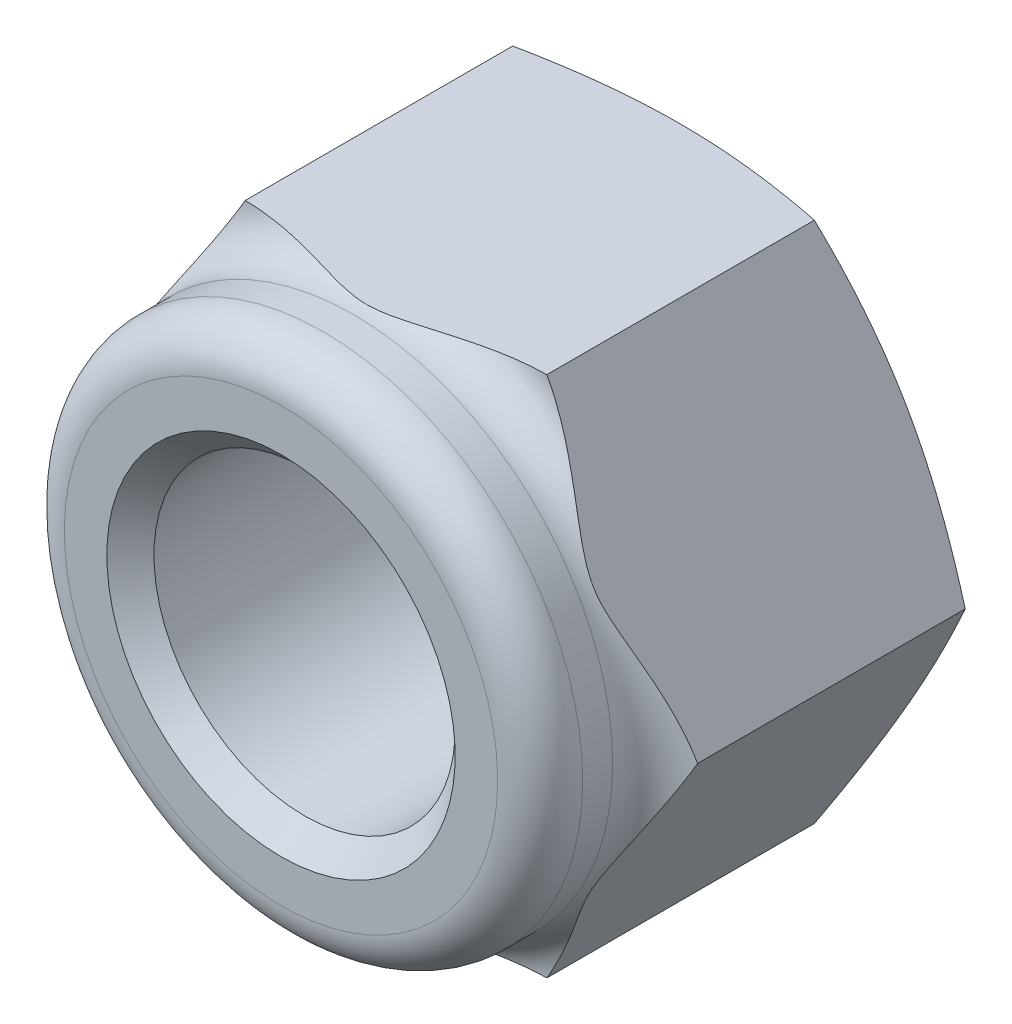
ISO-10303-21;
HEADER;
FILE_DESCRIPTION(('STEP AP214'),'2;1');
FILE_NAME('part.step','',(''),(''),'','','');
FILE_SCHEMA(('AUTOMOTIVE_DESIGN { 1 0 10303 214 1 1 1 1 }'));
ENDSEC;
DATA;
#1=APPLICATION_CONTEXT('core data for automotive mechanical design processes');
#2=APPLICATION_PROTOCOL_DEFINITION('international standard','automotive_design',2000,#1);
#3=PRODUCT_CONTEXT('',#1,'mechanical');
#4=PRODUCT('Part','Part','',(#3));
#5=PRODUCT_RELATED_PRODUCT_CATEGORY('part','',(#4));
#6=PRODUCT_DEFINITION_FORMATION('','',#4);
#7=PRODUCT_DEFINITION_CONTEXT('part definition',#1,'design');
#8=PRODUCT_DEFINITION('design','',#6,#7);
#9=PRODUCT_DEFINITION_SHAPE('','',#8);
#10=(LENGTH_UNIT() NAMED_UNIT(*) SI_UNIT(.MILLI.,.METRE.));
#11=(NAMED_UNIT(*) PLANE_ANGLE_UNIT() SI_UNIT($,.RADIAN.));
#12=(NAMED_UNIT(*) SI_UNIT($,.STERADIAN.) SOLID_ANGLE_UNIT());
#13=UNCERTAINTY_MEASURE_WITH_UNIT(LENGTH_MEASURE(1.E-05),#10,'distance_accuracy_value','');
#14=(GEOMETRIC_REPRESENTATION_CONTEXT(3) GLOBAL_UNCERTAINTY_ASSIGNED_CONTEXT((#13)) GLOBAL_UNIT_ASSIGNED_CONTEXT((#10,
#11,#12)) REPRESENTATION_CONTEXT('',''));
#15=CARTESIAN_POINT('',(0.,0.,0.));
#16=DIRECTION('',(0.,0.,1.));
#17=DIRECTION('',(1.,0.,0.));
#18=AXIS2_PLACEMENT_3D('',#15,#16,#17);
#19=CARTESIAN_POINT('',(0.,0.,0.));
#20=DIRECTION('',(0.,0.,0.999999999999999));
#21=DIRECTION('',(0.,-1.,0.));
#22=AXIS2_PLACEMENT_3D('',#19,#20,#21);
#23=CONICAL_SURFACE('',#22,13.5178665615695,1.18682389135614);
#24=CARTESIAN_POINT('',(0.,0.,0.));
#25=DIRECTION('',(0.,0.,0.999999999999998));
#26=DIRECTION('',(1.00000000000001,0.,0.));
#27=AXIS2_PLACEMENT_3D('',#24,#25,#26);
#28=CIRCLE('',#27,13.5178665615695);
#29=CARTESIAN_POINT('',(13.5178665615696,0.,0.));
#30=VERTEX_POINT('',#29);
#31=EDGE_CURVE('E201',#30,#30,#28,.T.);
#32=ORIENTED_EDGE('',*,*,#31,.T.);
#33=EDGE_LOOP('',(#32));
#34=FACE_BOUND('',#33,.T.);
#35=CARTESIAN_POINT('',(8.66024988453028,14.9999932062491,1.53636368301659));
#36=CARTESIAN_POINT('',(8.9628156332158,14.4759339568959,1.41411216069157));
#37=CARTESIAN_POINT('',(9.26638002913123,13.9501449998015,1.30107096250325));
#38=CARTESIAN_POINT('',(9.87551610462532,12.8950903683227,1.09688355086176));
#39=CARTESIAN_POINT('',(10.1810888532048,12.3658228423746,1.00575016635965));
#40=CARTESIAN_POINT('',(10.7938066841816,11.3045644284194,0.849027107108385));
#41=CARTESIAN_POINT('',(11.1009512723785,10.7725743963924,0.783429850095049));
#42=CARTESIAN_POINT('',(11.7163813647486,9.70661820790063,0.680818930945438));
#43=CARTESIAN_POINT('',(12.0246666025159,9.1726525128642,0.643798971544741));
#44=CARTESIAN_POINT('',(12.6365438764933,8.11284998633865,0.600644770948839));
#45=CARTESIAN_POINT('',(12.9401267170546,7.58702908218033,0.593996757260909));
#46=CARTESIAN_POINT('',(13.5471129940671,6.5356980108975,0.610546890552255));
#47=CARTESIAN_POINT('',(13.8505164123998,6.01018787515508,0.633747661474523));
#48=CARTESIAN_POINT('',(14.4562274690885,4.96106555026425,0.708748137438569));
#49=CARTESIAN_POINT('',(14.7585356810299,4.43745236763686,0.760529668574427));
#50=CARTESIAN_POINT('',(15.3617087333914,3.39272599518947,0.890182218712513));
#51=CARTESIAN_POINT('',(15.6625737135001,2.87161256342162,0.968050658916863));
#52=CARTESIAN_POINT('',(16.0760459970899,2.15545756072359,1.09113813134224));
#53=CARTESIAN_POINT('',(16.1894066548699,1.95911114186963,1.12655869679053));
#54=CARTESIAN_POINT('',(16.4158604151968,1.56688172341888,1.20048425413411));
#55=CARTESIAN_POINT('',(16.5289535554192,1.37099865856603,1.23898878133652));
#56=CARTESIAN_POINT('',(16.7552687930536,0.979009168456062,1.31904119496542));
#57=CARTESIAN_POINT('',(16.8684900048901,0.782904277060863,1.36059905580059));
#58=CARTESIAN_POINT('',(17.0946843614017,0.39112415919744,1.44646482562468));
#59=CARTESIAN_POINT('',(17.2076574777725,0.195448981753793,1.49077303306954));
#60=CARTESIAN_POINT('',(17.3205001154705,-1.99999405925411E-07,1.53636368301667));
#61=B_SPLINE_CURVE_WITH_KNOTS('',3,(#35,#36,#37,#38,#39,#40,#41,#42,#43,#44,#45,#46,#47,#48,#49,
#50,#51,#52,#53,#54,#55,#56,#57,#58,#59,#60),.UNSPECIFIED.,.F.,.F.,(4,2,2,2,2,2,2,2,2,2,2,2,4),
(0.,1.85220039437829,3.70548278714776,5.55821447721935,7.41053778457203,9.23140822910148,
11.0524387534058,12.8723126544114,14.6920067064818,15.3804082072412,16.0687061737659,
16.7593622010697,17.4500933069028),.UNSPECIFIED.);
#62=CARTESIAN_POINT('',(8.66024999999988,14.9999930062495,1.53636363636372));
#63=VERTEX_POINT('',#62);
#64=CARTESIAN_POINT('',(17.3205000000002,7.7715611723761E-13,1.53636363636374));
#65=VERTEX_POINT('',#64);
#66=EDGE_CURVE('E43',#63,#65,#61,.T.);
#67=ORIENTED_EDGE('',*,*,#66,.T.);
#68=CARTESIAN_POINT('',(17.3205001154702,2.00001237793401E-07,1.53636368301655));
#69=CARTESIAN_POINT('',(17.017934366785,-0.524059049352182,1.41411216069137));
#70=CARTESIAN_POINT('',(16.7143699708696,-1.04984800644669,1.30107096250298));
#71=CARTESIAN_POINT('',(16.1052338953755,-2.10490263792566,1.09688355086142));
#72=CARTESIAN_POINT('',(15.799661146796,-2.63417016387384,1.0057501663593));
#73=CARTESIAN_POINT('',(15.1869433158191,-3.69542857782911,0.849027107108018));
#74=CARTESIAN_POINT('',(14.8797987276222,-4.22741860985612,0.783429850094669));
#75=CARTESIAN_POINT('',(14.2643686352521,-5.29337479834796,0.680818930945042));
#76=CARTESIAN_POINT('',(13.9560833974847,-5.82734049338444,0.643798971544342));
#77=CARTESIAN_POINT('',(13.3442061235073,-6.88714301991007,0.600644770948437));
#78=CARTESIAN_POINT('',(13.0406232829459,-7.41296392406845,0.593996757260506));
#79=CARTESIAN_POINT('',(12.4336370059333,-8.46429499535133,0.610546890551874));
#80=CARTESIAN_POINT('',(12.1302335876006,-8.98980513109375,0.633747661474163));
#81=CARTESIAN_POINT('',(11.5245225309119,-10.0389274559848,0.708748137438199));
#82=CARTESIAN_POINT('',(11.2222143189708,-10.5625406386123,0.760529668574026));
#83=CARTESIAN_POINT('',(10.6190412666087,-11.6072670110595,0.890182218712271));
#84=CARTESIAN_POINT('',(10.3181762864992,-12.1283804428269,0.968050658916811));
#85=CARTESIAN_POINT('',(9.90470400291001,-12.8445354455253,1.09113813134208));
#86=CARTESIAN_POINT('',(9.79134334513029,-13.0408818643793,1.12655869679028));
#87=CARTESIAN_POINT('',(9.56488958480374,-13.4331112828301,1.20048425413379));
#88=CARTESIAN_POINT('',(9.4517964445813,-13.6289943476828,1.23898878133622));
#89=CARTESIAN_POINT('',(9.2254812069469,-14.0209838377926,1.31904119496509));
#90=CARTESIAN_POINT('',(9.11225999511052,-14.2170887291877,1.36059905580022));
#91=CARTESIAN_POINT('',(8.88606563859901,-14.608868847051,1.44646482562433));
#92=CARTESIAN_POINT('',(8.77309252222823,-14.8045440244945,1.49077303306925));
#93=CARTESIAN_POINT('',(8.66024988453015,-14.9999932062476,1.53636368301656));
#94=B_SPLINE_CURVE_WITH_KNOTS('',3,(#68,#69,#70,#71,#72,#73,#74,#75,#76,#77,#78,#79,#80,#81,#82,
#83,#84,#85,#86,#87,#88,#89,#90,#91,#92,#93),.UNSPECIFIED.,.F.,.F.,(4,2,2,2,2,2,2,2,2,2,2,2,4),
(0.,1.85220039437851,3.70548278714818,5.55821447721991,7.41053778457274,9.23140822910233,
11.0524387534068,12.8723126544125,14.6920067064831,15.3804082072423,16.0687061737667,
16.7593622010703,17.4500933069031),.UNSPECIFIED.);
#95=CARTESIAN_POINT('',(8.66024999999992,-14.999993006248,1.53636363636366));
#96=VERTEX_POINT('',#95);
#97=EDGE_CURVE('E36',#65,#96,#94,.T.);
#98=ORIENTED_EDGE('',*,*,#97,.T.);
#99=CARTESIAN_POINT('',(-22.8792761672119,-14.9999930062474,5.59178355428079));
#100=CARTESIAN_POINT('',(-22.5410565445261,-14.9999930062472,5.47750705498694));
#101=CARTESIAN_POINT('',(-22.2026075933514,-14.9999930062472,5.36390966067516));
#102=CARTESIAN_POINT('',(-21.5252036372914,-14.9999930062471,5.13822630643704));
#103=CARTESIAN_POINT('',(-21.186248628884,-14.9999930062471,5.02614035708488));
#104=CARTESIAN_POINT('',(-20.1684980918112,-14.9999930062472,4.69236142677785));
#105=CARTESIAN_POINT('',(-19.4888792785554,-14.9999930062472,4.47316845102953));
#106=CARTESIAN_POINT('',(-18.1253902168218,-14.9999930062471,4.04248114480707));
#107=CARTESIAN_POINT('',(-17.4415136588,-14.9999930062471,3.83100673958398));
#108=CARTESIAN_POINT('',(-16.0706700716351,-14.9999930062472,3.41834234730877));
#109=CARTESIAN_POINT('',(-15.3837031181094,-14.9999930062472,3.21715211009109));
#110=CARTESIAN_POINT('',(-14.0150039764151,-14.9999930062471,2.83016577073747));
#111=CARTESIAN_POINT('',(-13.3333187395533,-14.9999930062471,2.64420443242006));
#112=CARTESIAN_POINT('',(-11.9657997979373,-14.9999930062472,2.28801373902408));
#113=CARTESIAN_POINT('',(-11.2799659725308,-14.9999930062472,2.11778484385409));
#114=CARTESIAN_POINT('',(-9.90405404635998,-14.9999930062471,1.7971324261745));
#115=CARTESIAN_POINT('',(-9.21397856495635,-14.999993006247,1.64669775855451));
#116=CARTESIAN_POINT('',(-7.82892371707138,-14.9999930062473,1.37028952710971));
#117=CARTESIAN_POINT('',(-7.13394470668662,-14.9999930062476,1.24431420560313));
#118=CARTESIAN_POINT('',(-5.88185988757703,-14.9999930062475,1.04483486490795));
#119=CARTESIAN_POINT('',(-5.32562872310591,-14.9999930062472,0.965868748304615));
#120=CARTESIAN_POINT('',(-4.21052026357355,-14.999993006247,0.829390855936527));
#121=CARTESIAN_POINT('',(-3.65164303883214,-14.9999930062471,0.77187851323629));
#122=CARTESIAN_POINT('',(-2.53229208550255,-14.9999930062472,0.68058523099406));
#123=CARTESIAN_POINT('',(-1.97181962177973,-14.9999930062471,0.646788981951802));
#124=CARTESIAN_POINT('',(-0.849913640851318,-14.9999930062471,0.604344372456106));
#125=CARTESIAN_POINT('',(-0.288480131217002,-14.9999930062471,0.595695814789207));
#126=CARTESIAN_POINT('',(0.836917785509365,-14.9999930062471,0.603965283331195));
#127=CARTESIAN_POINT('',(1.40088127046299,-14.9999930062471,0.621007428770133));
#128=CARTESIAN_POINT('',(2.52748616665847,-14.9999930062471,0.680102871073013));
#129=CARTESIAN_POINT('',(3.09012755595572,-14.9999930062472,0.722156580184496));
#130=CARTESIAN_POINT('',(4.2135219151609,-14.9999930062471,0.829510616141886));
#131=CARTESIAN_POINT('',(4.77427345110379,-14.999993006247,0.894825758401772));
#132=CARTESIAN_POINT('',(5.89292694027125,-14.9999930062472,1.04624134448));
#133=CARTESIAN_POINT('',(6.45082890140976,-14.9999930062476,1.1323417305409));
#134=CARTESIAN_POINT('',(7.65673291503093,-14.9999930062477,1.33854778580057));
#135=CARTESIAN_POINT('',(8.30417035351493,-14.9999930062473,1.46193388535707));
#136=CARTESIAN_POINT('',(9.59485358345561,-14.9999930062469,1.72911444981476));
#137=CARTESIAN_POINT('',(10.2380988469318,-14.9999930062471,1.87291143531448));
#138=CARTESIAN_POINT('',(11.5209320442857,-14.9999930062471,2.17721515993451));
#139=CARTESIAN_POINT('',(12.1605180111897,-14.9999930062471,2.33773013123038));
#140=CARTESIAN_POINT('',(13.4361072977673,-14.9999930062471,2.67224291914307));
#141=CARTESIAN_POINT('',(14.072110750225,-14.9999930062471,2.84624023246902));
#142=CARTESIAN_POINT('',(15.3426806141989,-14.9999930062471,3.20562682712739));
#143=CARTESIAN_POINT('',(15.9772388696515,-14.9999930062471,3.39104481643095));
#144=CARTESIAN_POINT('',(17.2436776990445,-14.9999930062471,3.77079494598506));
#145=CARTESIAN_POINT('',(17.8755582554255,-14.9999930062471,3.96512714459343));
#146=CARTESIAN_POINT('',(19.1368584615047,-14.9999930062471,4.36101498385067));
#147=CARTESIAN_POINT('',(19.7662787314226,-14.9999930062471,4.56256865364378));
#148=CARTESIAN_POINT('',(21.0231670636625,-14.9999930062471,4.97165466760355));
#149=CARTESIAN_POINT('',(21.6506351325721,-14.9999930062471,5.17918699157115));
#150=CARTESIAN_POINT('',(22.8996680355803,-14.9999930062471,5.59778311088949));
#151=CARTESIAN_POINT('',(23.5212440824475,-14.9999930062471,5.8088135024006));
#152=CARTESIAN_POINT('',(24.7629962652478,-14.9999930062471,6.23495829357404));
#153=CARTESIAN_POINT('',(25.3831723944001,-14.9999930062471,6.45007271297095));
#154=CARTESIAN_POINT('',(26.6223639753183,-14.9999930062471,6.88375414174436));
#155=CARTESIAN_POINT('',(27.2413793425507,-14.9999930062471,7.10232139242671));
#156=CARTESIAN_POINT('',(28.4783731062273,-14.9999930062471,7.54237144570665));
#157=CARTESIAN_POINT('',(29.0963515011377,-14.9999930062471,7.76385425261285));
#158=CARTESIAN_POINT('',(30.3273240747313,-14.999993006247,8.20783520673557));
#159=CARTESIAN_POINT('',(30.9403241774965,-14.999993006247,8.4303169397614));
#160=CARTESIAN_POINT('',(32.1655532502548,-14.9999930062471,8.87739421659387));
#161=CARTESIAN_POINT('',(32.7777822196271,-14.9999930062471,9.10198976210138));
#162=CARTESIAN_POINT('',(34.0014881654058,-14.999993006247,9.55297935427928));
#163=CARTESIAN_POINT('',(34.6129652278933,-14.999993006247,9.77937316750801));
#164=CARTESIAN_POINT('',(35.8353231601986,-14.9999930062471,10.2337581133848));
#165=CARTESIAN_POINT('',(36.4462040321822,-14.9999930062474,10.4617492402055));
#166=CARTESIAN_POINT('',(37.05682776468,-14.9999930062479,10.6904250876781));
#167=B_SPLINE_CURVE_WITH_KNOTS('',3,(#99,#100,#101,#102,#103,#104,#105,#106,#107,#108,#109,#110,
#111,#112,#113,#114,#115,#116,#117,#118,#119,#120,#121,#122,#123,#124,#125,#126,#127,#128,#129,
#130,#131,#132,#133,#134,#135,#136,#137,#138,#139,#140,#141,#142,#143,#144,#145,#146,#147,#148,
#149,#150,#151,#152,#153,#154,#155,#156,#157,#158,#159,#160,#161,#162,#163,#164,#165,#166),
.UNSPECIFIED.,.F.,.F.,(4,2,2,2,2,2,2,2,2,2,2,2,2,2,2,2,2,2,2,2,2,2,2,2,2,2,2,2,2,2,2,2,2,4),(0.,
1.07100970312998,2.14202689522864,4.28425838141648,6.43167672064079,8.57904279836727,
10.6986800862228,12.8183793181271,14.9368799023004,17.0552281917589,18.7402944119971,
20.4253160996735,22.1092490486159,23.793168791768,25.4852501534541,27.1773594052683,
28.870548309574,30.5637325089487,32.540590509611,34.5176928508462,36.4957733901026,
38.4737801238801,40.4569796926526,42.4401922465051,44.4228676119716,46.4055362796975,
48.374787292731,50.3440478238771,52.3134465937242,54.2828482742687,56.2392193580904,
58.1955920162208,60.1517147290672,62.1078303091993),.UNSPECIFIED.);
#168=CARTESIAN_POINT('',(-8.66025000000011,-14.999993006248,1.53636363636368));
#169=VERTEX_POINT('',#168);
#170=EDGE_CURVE('E81',#96,#169,#167,.F.);
#171=ORIENTED_EDGE('',*,*,#170,.T.);
#172=CARTESIAN_POINT('',(-8.6602498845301,-14.9999932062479,1.53636368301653));
#173=CARTESIAN_POINT('',(-8.96281563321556,-14.4759339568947,1.41411216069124));
#174=CARTESIAN_POINT('',(-9.26638002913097,-13.9501449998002,1.30107096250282));
#175=CARTESIAN_POINT('',(-9.87551610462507,-12.8950903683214,1.09688355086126));
#176=CARTESIAN_POINT('',(-10.1810888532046,-12.3658228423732,1.00575016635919));
#177=CARTESIAN_POINT('',(-10.7938066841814,-11.304564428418,0.849027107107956));
#178=CARTESIAN_POINT('',(-11.1009512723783,-10.772574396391,0.783429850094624));
#179=CARTESIAN_POINT('',(-11.7163813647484,-9.70661820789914,0.680818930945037));
#180=CARTESIAN_POINT('',(-12.0246666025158,-9.17265251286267,0.643798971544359));
#181=CARTESIAN_POINT('',(-12.6365438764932,-8.11284998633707,0.600644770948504));
#182=CARTESIAN_POINT('',(-12.9401267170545,-7.58702908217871,0.5939967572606));
#183=CARTESIAN_POINT('',(-13.5471129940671,-6.53569801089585,0.610546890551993));
#184=CARTESIAN_POINT('',(-13.8505164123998,-6.01018787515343,0.633747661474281));
#185=CARTESIAN_POINT('',(-14.4562274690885,-4.96106555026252,0.708748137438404));
#186=CARTESIAN_POINT('',(-14.7585356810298,-4.43745236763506,0.760529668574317));
#187=CARTESIAN_POINT('',(-15.3617087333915,-3.39272599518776,0.890182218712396));
#188=CARTESIAN_POINT('',(-15.6625737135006,-2.87161256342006,0.968050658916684));
#189=CARTESIAN_POINT('',(-16.0760459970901,-2.15545756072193,1.09113813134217));
#190=CARTESIAN_POINT('',(-16.18940665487,-1.95911114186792,1.1265586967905));
#191=CARTESIAN_POINT('',(-16.4158604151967,-1.56688172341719,1.20048425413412));
#192=CARTESIAN_POINT('',(-16.5289535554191,-1.37099865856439,1.23898878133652));
#193=CARTESIAN_POINT('',(-16.7552687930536,-0.979009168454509,1.31904119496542));
#194=CARTESIAN_POINT('',(-16.86849000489,-0.782904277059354,1.3605990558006));
#195=CARTESIAN_POINT('',(-17.0946843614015,-0.391124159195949,1.44646482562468));
#196=CARTESIAN_POINT('',(-17.2076574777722,-0.195448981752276,1.49077303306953));
#197=CARTESIAN_POINT('',(-17.32050011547,2.00001015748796E-07,1.53636368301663));
#198=B_SPLINE_CURVE_WITH_KNOTS('',3,(#172,#173,#174,#175,#176,#177,#178,#179,#180,#181,#182,
#183,#184,#185,#186,#187,#188,#189,#190,#191,#192,#193,#194,#195,#196,#197),.UNSPECIFIED.,.F.,
.F.,(4,2,2,2,2,2,2,2,2,2,2,2,4),(0.,1.85220039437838,3.70548278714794,5.55821447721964,
7.41053778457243,9.23140822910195,11.0524387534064,12.872312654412,14.6920067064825,
15.3804082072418,16.0687061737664,16.7593622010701,17.450093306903),.UNSPECIFIED.);
#199=CARTESIAN_POINT('',(-17.3205,9.43689570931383E-13,1.53636363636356));
#200=VERTEX_POINT('',#199);
#201=EDGE_CURVE('E89',#169,#200,#198,.T.);
#202=ORIENTED_EDGE('',*,*,#201,.T.);
#203=CARTESIAN_POINT('',(-17.3205001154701,-1.99999627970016E-07,1.53636368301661));
#204=CARTESIAN_POINT('',(-17.0179343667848,0.524059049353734,1.41411216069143));
#205=CARTESIAN_POINT('',(-16.7143699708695,1.04984800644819,1.30107096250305));
#206=CARTESIAN_POINT('',(-16.1052338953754,2.10490263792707,1.09688355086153));
#207=CARTESIAN_POINT('',(-15.7996611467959,2.63417016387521,1.00575016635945));
#208=CARTESIAN_POINT('',(-15.1869433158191,3.69542857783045,0.849027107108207));
#209=CARTESIAN_POINT('',(-14.8797987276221,4.22741860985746,0.783429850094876));
#210=CARTESIAN_POINT('',(-14.264368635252,5.29337479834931,0.680818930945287));
#211=CARTESIAN_POINT('',(-13.9560833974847,5.82734049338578,0.643798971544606));
#212=CARTESIAN_POINT('',(-13.3442061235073,6.8871430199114,0.600644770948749));
#213=CARTESIAN_POINT('',(-13.0406232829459,7.41296392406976,0.593996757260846));
#214=CARTESIAN_POINT('',(-12.4336370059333,8.46429499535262,0.610546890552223));
#215=CARTESIAN_POINT('',(-12.1302335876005,8.98980513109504,0.633747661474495));
#216=CARTESIAN_POINT('',(-11.5245225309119,10.038927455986,0.708748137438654));
#217=CARTESIAN_POINT('',(-11.2222143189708,10.5625406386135,0.76052966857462));
#218=CARTESIAN_POINT('',(-10.6190412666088,11.6072670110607,0.890182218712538));
#219=CARTESIAN_POINT('',(-10.3181762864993,12.1283804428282,0.968050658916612));
#220=CARTESIAN_POINT('',(-9.90470400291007,12.8445354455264,1.09113813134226));
#221=CARTESIAN_POINT('',(-9.79134334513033,13.0408818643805,1.12655869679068));
#222=CARTESIAN_POINT('',(-9.56488958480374,13.4331112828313,1.20048425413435));
#223=CARTESIAN_POINT('',(-9.45179644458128,13.6289943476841,1.23898878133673));
#224=CARTESIAN_POINT('',(-9.22548120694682,14.020983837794,1.31904119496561));
#225=CARTESIAN_POINT('',(-9.11225999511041,14.2170887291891,1.36059905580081));
#226=CARTESIAN_POINT('',(-8.88606563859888,14.6088688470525,1.44646482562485));
#227=CARTESIAN_POINT('',(-8.77309252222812,14.8045440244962,1.49077303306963));
#228=CARTESIAN_POINT('',(-8.66024988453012,14.9999932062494,1.53636368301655));
#229=B_SPLINE_CURVE_WITH_KNOTS('',3,(#203,#204,#205,#206,#207,#208,#209,#210,#211,#212,#213,
#214,#215,#216,#217,#218,#219,#220,#221,#222,#223,#224,#225,#226,#227,#228),.UNSPECIFIED.,.F.,
.F.,(4,2,2,2,2,2,2,2,2,2,2,2,4),(0.,1.85220039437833,3.70548278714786,5.5582144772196,
7.41053778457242,9.23140822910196,11.0524387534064,12.8723126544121,14.6920067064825,
15.3804082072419,16.0687061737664,16.7593622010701,17.4500933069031),.UNSPECIFIED.);
#230=CARTESIAN_POINT('',(-8.66024999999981,14.9999930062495,1.53636363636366));
#231=VERTEX_POINT('',#230);
#232=EDGE_CURVE('E94',#200,#231,#229,.T.);
#233=ORIENTED_EDGE('',*,*,#232,.T.);
#234=CARTESIAN_POINT('',(-22.8792761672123,14.9999930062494,5.59178355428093));
#235=CARTESIAN_POINT('',(-22.5410565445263,14.9999930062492,5.47750705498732));
#236=CARTESIAN_POINT('',(-22.2026075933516,14.9999930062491,5.36390966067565));
#237=CARTESIAN_POINT('',(-21.5252036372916,14.999993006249,5.13822630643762));
#238=CARTESIAN_POINT('',(-21.1862486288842,14.999993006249,5.02614035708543));
#239=CARTESIAN_POINT('',(-20.1684980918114,14.9999930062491,4.69236142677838));
#240=CARTESIAN_POINT('',(-19.4888792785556,14.9999930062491,4.47316845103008));
#241=CARTESIAN_POINT('',(-18.1253902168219,14.999993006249,4.04248114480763));
#242=CARTESIAN_POINT('',(-17.4415136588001,14.999993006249,3.83100673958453));
#243=CARTESIAN_POINT('',(-16.070670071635,14.9999930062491,3.41834234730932));
#244=CARTESIAN_POINT('',(-15.3837031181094,14.9999930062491,3.21715211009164));
#245=CARTESIAN_POINT('',(-14.015003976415,14.9999930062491,2.83016577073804));
#246=CARTESIAN_POINT('',(-13.3333187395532,14.999993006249,2.64420443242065));
#247=CARTESIAN_POINT('',(-11.9657997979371,14.9999930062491,2.28801373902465));
#248=CARTESIAN_POINT('',(-11.2799659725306,14.9999930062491,2.11778484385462));
#249=CARTESIAN_POINT('',(-9.90405404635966,14.999993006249,1.79713242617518));
#250=CARTESIAN_POINT('',(-9.21397856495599,14.9999930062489,1.64669775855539));
#251=CARTESIAN_POINT('',(-7.82892371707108,14.9999930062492,1.37028952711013));
#252=CARTESIAN_POINT('',(-7.13394470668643,14.9999930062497,1.2443142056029));
#253=CARTESIAN_POINT('',(-5.88185988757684,14.9999930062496,1.04483486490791));
#254=CARTESIAN_POINT('',(-5.32562872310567,14.9999930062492,0.965868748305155));
#255=CARTESIAN_POINT('',(-4.21052026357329,14.999993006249,0.829390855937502));
#256=CARTESIAN_POINT('',(-3.65164303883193,14.9999930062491,0.771878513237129));
#257=CARTESIAN_POINT('',(-2.53229208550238,14.9999930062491,0.68058523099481));
#258=CARTESIAN_POINT('',(-1.97181962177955,14.9999930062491,0.646788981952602));
#259=CARTESIAN_POINT('',(-0.849913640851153,14.9999930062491,0.604344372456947));
#260=CARTESIAN_POINT('',(-0.288480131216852,14.9999930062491,0.59569581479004));
#261=CARTESIAN_POINT('',(0.836917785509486,14.9999930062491,0.603965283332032));
#262=CARTESIAN_POINT('',(1.4008812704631,14.9999930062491,0.621007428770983));
#263=CARTESIAN_POINT('',(2.52748616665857,14.9999930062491,0.680102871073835));
#264=CARTESIAN_POINT('',(3.09012755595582,14.9999930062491,0.722156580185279));
#265=CARTESIAN_POINT('',(4.21352191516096,14.9999930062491,0.829510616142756));
#266=CARTESIAN_POINT('',(4.77427345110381,14.9999930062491,0.894825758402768));
#267=CARTESIAN_POINT('',(5.89292694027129,14.9999930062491,1.04624134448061));
#268=CARTESIAN_POINT('',(6.45082890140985,14.9999930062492,1.132341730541));
#269=CARTESIAN_POINT('',(7.65673291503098,14.9999930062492,1.33854778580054));
#270=CARTESIAN_POINT('',(8.30417035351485,14.9999930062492,1.46193388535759));
#271=CARTESIAN_POINT('',(9.59485358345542,14.9999930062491,1.72911444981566));
#272=CARTESIAN_POINT('',(10.2380988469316,14.9999930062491,1.87291143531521));
#273=CARTESIAN_POINT('',(11.5209320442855,14.9999930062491,2.17721515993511));
#274=CARTESIAN_POINT('',(12.1605180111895,14.9999930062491,2.337730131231));
#275=CARTESIAN_POINT('',(13.4361072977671,14.9999930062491,2.67224291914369));
#276=CARTESIAN_POINT('',(14.0721107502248,14.9999930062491,2.84624023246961));
#277=CARTESIAN_POINT('',(15.3426806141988,14.9999930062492,3.20562682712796));
#278=CARTESIAN_POINT('',(15.9772388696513,14.9999930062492,3.39104481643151));
#279=CARTESIAN_POINT('',(17.2436776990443,14.9999930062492,3.77079494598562));
#280=CARTESIAN_POINT('',(17.8755582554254,14.9999930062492,3.96512714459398));
#281=CARTESIAN_POINT('',(19.1368584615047,14.9999930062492,4.3610149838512));
#282=CARTESIAN_POINT('',(19.7662787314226,14.9999930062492,4.5625686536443));
#283=CARTESIAN_POINT('',(21.0231670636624,14.9999930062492,4.97165466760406));
#284=CARTESIAN_POINT('',(21.650635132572,14.9999930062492,5.17918699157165));
#285=CARTESIAN_POINT('',(22.8996680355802,14.9999930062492,5.59778311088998));
#286=CARTESIAN_POINT('',(23.5212440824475,14.9999930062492,5.80881350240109));
#287=CARTESIAN_POINT('',(24.7629962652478,14.9999930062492,6.23495829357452));
#288=CARTESIAN_POINT('',(25.3831723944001,14.9999930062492,6.45007271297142));
#289=CARTESIAN_POINT('',(26.6223639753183,14.9999930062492,6.88375414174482));
#290=CARTESIAN_POINT('',(27.2413793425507,14.9999930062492,7.10232139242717));
#291=CARTESIAN_POINT('',(28.4783731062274,14.9999930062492,7.54237144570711));
#292=CARTESIAN_POINT('',(29.0963515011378,14.9999930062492,7.7638542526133));
#293=CARTESIAN_POINT('',(30.3273240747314,14.9999930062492,8.20783520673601));
#294=CARTESIAN_POINT('',(30.9403241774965,14.9999930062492,8.43031693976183));
#295=CARTESIAN_POINT('',(32.1655532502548,14.9999930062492,8.87739421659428));
#296=CARTESIAN_POINT('',(32.7777822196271,14.9999930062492,9.10198976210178));
#297=CARTESIAN_POINT('',(34.0014881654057,14.9999930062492,9.55297935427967));
#298=CARTESIAN_POINT('',(34.6129652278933,14.9999930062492,9.77937316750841));
#299=CARTESIAN_POINT('',(35.8353231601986,14.9999930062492,10.2337581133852));
#300=CARTESIAN_POINT('',(36.4462040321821,14.9999930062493,10.4617492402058));
#301=CARTESIAN_POINT('',(37.05682776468,14.9999930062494,10.6904250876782));
#302=B_SPLINE_CURVE_WITH_KNOTS('',3,(#234,#235,#236,#237,#238,#239,#240,#241,#242,#243,#244,
#245,#246,#247,#248,#249,#250,#251,#252,#253,#254,#255,#256,#257,#258,#259,#260,#261,#262,#263,
#264,#265,#266,#267,#268,#269,#270,#271,#272,#273,#274,#275,#276,#277,#278,#279,#280,#281,#282,
#283,#284,#285,#286,#287,#288,#289,#290,#291,#292,#293,#294,#295,#296,#297,#298,#299,#300,#301),
.UNSPECIFIED.,.F.,.F.,(4,2,2,2,2,2,2,2,2,2,2,2,2,2,2,2,2,2,2,2,2,2,2,2,2,2,2,2,2,2,2,2,2,4),(0.,
1.07100970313,2.14202689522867,4.28425838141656,6.43167672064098,8.57904279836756,
10.6986800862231,12.8183793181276,14.9368799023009,17.0552281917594,18.7402944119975,
20.4253160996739,22.1092490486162,23.7931687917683,25.4852501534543,27.1773594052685,
28.8705483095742,30.5637325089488,32.5405905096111,34.5176928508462,36.4957733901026,
38.4737801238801,40.4569796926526,42.4401922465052,44.4228676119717,46.4055362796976,
48.374787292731,50.3440478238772,52.3134465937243,54.2828482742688,56.2392193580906,
58.1955920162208,60.1517147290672,62.1078303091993),.UNSPECIFIED.);
#303=EDGE_CURVE('E179',#231,#63,#302,.T.);
#304=ORIENTED_EDGE('',*,*,#303,.T.);
#305=EDGE_LOOP('',(#67,#98,#171,#202,#233,#304));
#306=FACE_BOUND('',#305,.T.);
#307=ADVANCED_FACE('F16',(#34,#306),#23,.T.);
#308=CARTESIAN_POINT('',(17.3205000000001,8.88178419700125E-13,0.));
#309=DIRECTION('',(0.,0.,0.999999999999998));
#310=DIRECTION('',(1.00000000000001,0.,0.));
#311=AXIS2_PLACEMENT_3D('',#308,#309,#310);
#312=PLANE('',#311);
#313=CARTESIAN_POINT('',(0.,0.,0.));
#314=DIRECTION('',(0.,0.,0.999999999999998));
#315=DIRECTION('',(1.00000000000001,0.,0.));
#316=AXIS2_PLACEMENT_3D('',#313,#314,#315);
#317=CIRCLE('',#316,10.);
#318=CARTESIAN_POINT('',(0.,10.,0.));
#319=VERTEX_POINT('',#318);
#320=EDGE_CURVE('E204',#319,#319,#317,.F.);
#321=ORIENTED_EDGE('',*,*,#320,.F.);
#322=EDGE_LOOP('',(#321));
#323=FACE_BOUND('',#322,.T.);
#324=ORIENTED_EDGE('',*,*,#31,.F.);
#325=EDGE_LOOP('',(#324));
#326=FACE_BOUND('',#325,.T.);
#327=ADVANCED_FACE('F223',(#323,#326),#312,.F.);
#328=CARTESIAN_POINT('',(1.2490009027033E-13,4.44089209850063E-13,23.5));
#329=DIRECTION('',(0.,0.,0.999999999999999));
#330=DIRECTION('',(0.,-1.,0.));
#331=AXIS2_PLACEMENT_3D('',#328,#329,#330);
#332=CONICAL_SURFACE('',#331,10.,0.785398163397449);
#333=CARTESIAN_POINT('',(1.52655665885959E-13,6.10622663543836E-13,22.146875));
#334=DIRECTION('',(0.,0.,-0.999999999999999));
#335=DIRECTION('',(0.,1.,0.));
#336=AXIS2_PLACEMENT_3D('',#333,#334,#335);
#337=CIRCLE('',#336,8.646875);
#338=CARTESIAN_POINT('',(1.45895448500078E-13,-8.64687499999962,22.146875));
#339=VERTEX_POINT('',#338);
#340=EDGE_CURVE('E243',#339,#339,#337,.T.);
#341=CARTESIAN_POINT('',(1.2490009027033E-13,4.44089209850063E-13,23.5));
#342=DIRECTION('',(0.,0.,-0.999999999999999));
#343=DIRECTION('',(0.,1.,0.));
#344=AXIS2_PLACEMENT_3D('',#341,#342,#343);
#345=CIRCLE('',#344,10.);
#346=CARTESIAN_POINT('',(1.52655665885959E-13,-9.99999999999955,23.4999999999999));
#347=VERTEX_POINT('',#346);
#348=EDGE_CURVE('E246',#347,#347,#345,.T.);
#349=CARTESIAN_POINT('',(1.45895448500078E-13,-8.64687499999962,22.146875));
#350=CARTESIAN_POINT('',(1.45965867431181E-13,-8.66097005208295,22.1609700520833));
#351=CARTESIAN_POINT('',(1.46036286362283E-13,-8.67506510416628,22.1750651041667));
#352=CARTESIAN_POINT('',(1.46177124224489E-13,-8.70325520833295,22.2032552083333));
#353=CARTESIAN_POINT('',(1.46247543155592E-13,-8.71735026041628,22.2173502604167));
#354=CARTESIAN_POINT('',(1.46388381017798E-13,-8.74554036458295,22.2455403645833));
#355=CARTESIAN_POINT('',(1.46458799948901E-13,-8.75963541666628,22.2596354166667));
#356=CARTESIAN_POINT('',(1.46599637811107E-13,-8.78782552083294,22.2878255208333));
#357=CARTESIAN_POINT('',(1.4667005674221E-13,-8.80192057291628,22.3019205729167));
#358=CARTESIAN_POINT('',(1.46810894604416E-13,-8.83011067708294,22.3301106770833));
#359=CARTESIAN_POINT('',(1.46881313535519E-13,-8.84420572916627,22.3442057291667));
#360=CARTESIAN_POINT('',(1.47022151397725E-13,-8.87239583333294,22.3723958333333));
#361=CARTESIAN_POINT('',(1.47092570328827E-13,-8.88649088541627,22.3864908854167));
#362=CARTESIAN_POINT('',(1.47233408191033E-13,-8.91468098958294,22.4146809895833));
#363=CARTESIAN_POINT('',(1.47303827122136E-13,-8.92877604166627,22.4287760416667));
#364=CARTESIAN_POINT('',(1.47444664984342E-13,-8.95696614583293,22.4569661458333));
#365=CARTESIAN_POINT('',(1.47515083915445E-13,-8.97106119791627,22.4710611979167));
#366=CARTESIAN_POINT('',(1.47655921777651E-13,-8.99925130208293,22.4992513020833));
#367=CARTESIAN_POINT('',(1.47726340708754E-13,-9.01334635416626,22.5133463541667));
#368=CARTESIAN_POINT('',(1.4786717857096E-13,-9.04153645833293,22.5415364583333));
#369=CARTESIAN_POINT('',(1.47937597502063E-13,-9.05563151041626,22.5556315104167));
#370=CARTESIAN_POINT('',(1.48078435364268E-13,-9.08382161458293,22.5838216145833));
#371=CARTESIAN_POINT('',(1.48148854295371E-13,-9.09791666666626,22.5979166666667));
#372=CARTESIAN_POINT('',(1.48289692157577E-13,-9.12610677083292,22.6261067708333));
#373=CARTESIAN_POINT('',(1.4836011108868E-13,-9.14020182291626,22.6402018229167));
#374=CARTESIAN_POINT('',(1.48500948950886E-13,-9.16839192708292,22.6683919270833));
#375=CARTESIAN_POINT('',(1.48571367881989E-13,-9.18248697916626,22.6824869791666));
#376=CARTESIAN_POINT('',(1.48712205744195E-13,-9.21067708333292,22.7106770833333));
#377=CARTESIAN_POINT('',(1.48782624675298E-13,-9.22477213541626,22.7247721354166));
#378=CARTESIAN_POINT('',(1.48923462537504E-13,-9.25296223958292,22.7529622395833));
#379=CARTESIAN_POINT('',(1.48993881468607E-13,-9.26705729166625,22.7670572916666));
#380=CARTESIAN_POINT('',(1.49134719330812E-13,-9.29524739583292,22.7952473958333));
#381=CARTESIAN_POINT('',(1.49205138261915E-13,-9.30934244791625,22.8093424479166));
#382=CARTESIAN_POINT('',(1.49345976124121E-13,-9.33753255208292,22.8375325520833));
#383=CARTESIAN_POINT('',(1.49416395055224E-13,-9.35162760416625,22.8516276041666));
#384=CARTESIAN_POINT('',(1.4955723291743E-13,-9.37981770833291,22.8798177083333));
#385=CARTESIAN_POINT('',(1.49627651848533E-13,-9.39391276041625,22.8939127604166));
#386=CARTESIAN_POINT('',(1.49768489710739E-13,-9.42210286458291,22.9221028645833));
#387=CARTESIAN_POINT('',(1.49838908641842E-13,-9.43619791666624,22.9361979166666));
#388=CARTESIAN_POINT('',(1.49979746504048E-13,-9.46438802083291,22.9643880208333));
#389=CARTESIAN_POINT('',(1.5005016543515E-13,-9.47848307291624,22.9784830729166));
#390=CARTESIAN_POINT('',(1.50191003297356E-13,-9.50667317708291,23.0066731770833));
#391=CARTESIAN_POINT('',(1.50261422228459E-13,-9.52076822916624,23.0207682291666));
#392=CARTESIAN_POINT('',(1.50402260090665E-13,-9.54895833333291,23.0489583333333));
#393=CARTESIAN_POINT('',(1.50472679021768E-13,-9.56305338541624,23.0630533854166));
#394=CARTESIAN_POINT('',(1.50613516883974E-13,-9.5912434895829,23.0912434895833));
#395=CARTESIAN_POINT('',(1.50683935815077E-13,-9.60533854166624,23.1053385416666));
#396=CARTESIAN_POINT('',(1.50824773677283E-13,-9.6335286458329,23.1335286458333));
#397=CARTESIAN_POINT('',(1.50895192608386E-13,-9.64762369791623,23.1476236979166));
#398=CARTESIAN_POINT('',(1.51036030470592E-13,-9.6758138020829,23.1758138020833));
#399=CARTESIAN_POINT('',(1.51106449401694E-13,-9.68990885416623,23.1899088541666));
#400=CARTESIAN_POINT('',(1.512472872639E-13,-9.7180989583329,23.2180989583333));
#401=CARTESIAN_POINT('',(1.51317706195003E-13,-9.73219401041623,23.2321940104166));
#402=CARTESIAN_POINT('',(1.51458544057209E-13,-9.76038411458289,23.2603841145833));
#403=CARTESIAN_POINT('',(1.51528962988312E-13,-9.77447916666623,23.2744791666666));
#404=CARTESIAN_POINT('',(1.51669800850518E-13,-9.80266927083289,23.3026692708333));
#405=CARTESIAN_POINT('',(1.51740219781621E-13,-9.81676432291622,23.3167643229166));
#406=CARTESIAN_POINT('',(1.51881057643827E-13,-9.84495442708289,23.3449544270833));
#407=CARTESIAN_POINT('',(1.5195147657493E-13,-9.85904947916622,23.3590494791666));
#408=CARTESIAN_POINT('',(1.52092314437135E-13,-9.88723958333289,23.3872395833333));
#409=CARTESIAN_POINT('',(1.52162733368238E-13,-9.90133463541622,23.4013346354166));
#410=CARTESIAN_POINT('',(1.52303571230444E-13,-9.92952473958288,23.4295247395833));
#411=CARTESIAN_POINT('',(1.52373990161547E-13,-9.94361979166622,23.4436197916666));
#412=CARTESIAN_POINT('',(1.52514828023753E-13,-9.97180989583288,23.4718098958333));
#413=CARTESIAN_POINT('',(1.52585246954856E-13,-9.98590494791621,23.4859049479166));
#414=CARTESIAN_POINT('',(1.52655665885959E-13,-9.99999999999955,23.4999999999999));
#415=B_SPLINE_CURVE_WITH_KNOTS('',3,(#349,#350,#351,#352,#353,#354,#355,#356,#357,#358,#359,
#360,#361,#362,#363,#364,#365,#366,#367,#368,#369,#370,#371,#372,#373,#374,#375,#376,#377,#378,
#379,#380,#381,#382,#383,#384,#385,#386,#387,#388,#389,#390,#391,#392,#393,#394,#395,#396,#397,
#398,#399,#400,#401,#402,#403,#404,#405,#406,#407,#408,#409,#410,#411,#412,#413,#414),
.UNSPECIFIED.,.F.,.F.,(4,2,2,2,2,2,2,2,2,2,2,2,2,2,2,2,2,2,2,2,2,2,2,2,2,2,2,2,2,2,2,2,4),(0.,
0.0598002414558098,0.119600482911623,0.179400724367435,0.239200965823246,0.299001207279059,
0.358801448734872,0.418601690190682,0.478401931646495,0.538202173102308,0.598002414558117,
0.657802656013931,0.717602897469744,0.777403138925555,0.837203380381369,0.897003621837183,
0.956803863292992,1.0166041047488,1.07640434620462,1.13620458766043,1.19600482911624,
1.25580507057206,1.31560531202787,1.37540555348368,1.43520579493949,1.4950060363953,
1.55480627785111,1.61460651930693,1.67440676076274,1.73420700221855,1.79400724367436,
1.85380748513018,1.91360772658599),.UNSPECIFIED.);
#416=EDGE_CURVE('BSEAM228',#339,#347,#415,.T.);
#417=ORIENTED_EDGE('',*,*,#340,.T.);
#418=ORIENTED_EDGE('',*,*,#348,.F.);
#419=ORIENTED_EDGE('',*,*,#416,.T.);
#420=ORIENTED_EDGE('',*,*,#416,.F.);
#421=EDGE_LOOP('',(#417,#419,#418,#420));
#422=FACE_BOUND('',#421,.T.);
#423=ADVANCED_FACE('F228',(#422),#332,.F.);
#424=CARTESIAN_POINT('',(0.,0.,0.));
#425=DIRECTION('',(0.,0.,-0.999999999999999));
#426=DIRECTION('',(0.,1.,0.));
#427=AXIS2_PLACEMENT_3D('',#424,#425,#426);
#428=CYLINDRICAL_SURFACE('',#427,8.646875);
#429=CARTESIAN_POINT('',(0.,0.,1.35312499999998));
#430=DIRECTION('',(0.,0.,-0.999999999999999));
#431=DIRECTION('',(0.,1.,0.));
#432=AXIS2_PLACEMENT_3D('',#429,#430,#431);
#433=CIRCLE('',#432,8.646875);
#434=CARTESIAN_POINT('',(0.,8.64687500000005,1.35312499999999));
#435=VERTEX_POINT('',#434);
#436=EDGE_CURVE('E241',#435,#435,#433,.T.);
#437=ORIENTED_EDGE('',*,*,#436,.T.);
#438=EDGE_LOOP('',(#437));
#439=FACE_BOUND('',#438,.T.);
#440=ORIENTED_EDGE('',*,*,#340,.F.);
#441=EDGE_LOOP('',(#440));
#442=FACE_BOUND('',#441,.T.);
#443=ADVANCED_FACE('F219',(#439,#442),#428,.F.);
#444=CARTESIAN_POINT('',(0.,0.,1.35312499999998));
#445=DIRECTION('',(0.,0.,-0.999999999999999));
#446=DIRECTION('',(0.,1.,0.));
#447=AXIS2_PLACEMENT_3D('',#444,#445,#446);
#448=CONICAL_SURFACE('',#447,8.646875,0.785398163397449);
#449=CARTESIAN_POINT('',(0.,10.,0.));
#450=CARTESIAN_POINT('',(0.,9.9859049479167,0.0140950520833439));
#451=CARTESIAN_POINT('',(0.,9.97180989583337,0.0281901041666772));
#452=CARTESIAN_POINT('',(0.,9.9436197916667,0.0563802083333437));
#453=CARTESIAN_POINT('',(0.,9.92952473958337,0.0704752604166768));
#454=CARTESIAN_POINT('',(0.,9.9013346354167,0.0986653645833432));
#455=CARTESIAN_POINT('',(0.,9.88723958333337,0.112760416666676));
#456=CARTESIAN_POINT('',(0.,9.85904947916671,0.140950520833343));
#457=CARTESIAN_POINT('',(0.,9.84495442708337,0.155045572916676));
#458=CARTESIAN_POINT('',(0.,9.8167643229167,0.183235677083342));
#459=CARTESIAN_POINT('',(0.,9.80266927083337,0.197330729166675));
#460=CARTESIAN_POINT('',(0.,9.7744791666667,0.225520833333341));
#461=CARTESIAN_POINT('',(0.,9.76038411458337,0.239615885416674));
#462=CARTESIAN_POINT('',(0.,9.73219401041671,0.267805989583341));
#463=CARTESIAN_POINT('',(0.,9.71809895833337,0.281901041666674));
#464=CARTESIAN_POINT('',(0.,9.68990885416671,0.31009114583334));
#465=CARTESIAN_POINT('',(0.,9.67581380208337,0.324186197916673));
#466=CARTESIAN_POINT('',(0.,9.64762369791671,0.35237630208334));
#467=CARTESIAN_POINT('',(0.,9.63352864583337,0.366471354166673));
#468=CARTESIAN_POINT('',(0.,9.60533854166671,0.394661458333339));
#469=CARTESIAN_POINT('',(0.,9.59124348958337,0.408756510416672));
#470=CARTESIAN_POINT('',(0.,9.56305338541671,0.436946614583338));
#471=CARTESIAN_POINT('',(0.,9.54895833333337,0.451041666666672));
#472=CARTESIAN_POINT('',(0.,9.52076822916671,0.479231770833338));
#473=CARTESIAN_POINT('',(0.,9.50667317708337,0.493326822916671));
#474=CARTESIAN_POINT('',(0.,9.47848307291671,0.521516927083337));
#475=CARTESIAN_POINT('',(0.,9.46438802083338,0.535611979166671));
#476=CARTESIAN_POINT('',(0.,9.43619791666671,0.563802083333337));
#477=CARTESIAN_POINT('',(0.,9.42210286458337,0.57789713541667));
#478=CARTESIAN_POINT('',(0.,9.39391276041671,0.606087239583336));
#479=CARTESIAN_POINT('',(0.,9.37981770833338,0.620182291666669));
#480=CARTESIAN_POINT('',(0.,9.35162760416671,0.648372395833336));
#481=CARTESIAN_POINT('',(0.,9.33753255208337,0.662467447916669));
#482=CARTESIAN_POINT('',(0.,9.30934244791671,0.690657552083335));
#483=CARTESIAN_POINT('',(0.,9.29524739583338,0.704752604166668));
#484=CARTESIAN_POINT('',(0.,9.26705729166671,0.732942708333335));
#485=CARTESIAN_POINT('',(0.,9.25296223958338,0.747037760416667));
#486=CARTESIAN_POINT('',(0.,9.22477213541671,0.775227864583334));
#487=CARTESIAN_POINT('',(0.,9.21067708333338,0.789322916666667));
#488=CARTESIAN_POINT('',(0.,9.18248697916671,0.817513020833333));
#489=CARTESIAN_POINT('',(0.,9.16839192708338,0.831608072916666));
#490=CARTESIAN_POINT('',(0.,9.14020182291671,0.859798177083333));
#491=CARTESIAN_POINT('',(0.,9.12610677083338,0.873893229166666));
#492=CARTESIAN_POINT('',(0.,9.09791666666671,0.902083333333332));
#493=CARTESIAN_POINT('',(0.,9.08382161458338,0.916178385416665));
#494=CARTESIAN_POINT('',(0.,9.05563151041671,0.944368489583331));
#495=CARTESIAN_POINT('',(0.,9.04153645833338,0.958463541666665));
#496=CARTESIAN_POINT('',(0.,9.01334635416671,0.986653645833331));
#497=CARTESIAN_POINT('',(0.,8.99925130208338,1.00074869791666));
#498=CARTESIAN_POINT('',(0.,8.97106119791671,1.02893880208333));
#499=CARTESIAN_POINT('',(0.,8.95696614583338,1.04303385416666));
#500=CARTESIAN_POINT('',(0.,8.92877604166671,1.07122395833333));
#501=CARTESIAN_POINT('',(0.,8.91468098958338,1.08531901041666));
#502=CARTESIAN_POINT('',(0.,8.88649088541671,1.11350911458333));
#503=CARTESIAN_POINT('',(0.,8.87239583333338,1.12760416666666));
#504=CARTESIAN_POINT('',(0.,8.84420572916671,1.15579427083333));
#505=CARTESIAN_POINT('',(0.,8.83011067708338,1.16988932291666));
#506=CARTESIAN_POINT('',(0.,8.80192057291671,1.19807942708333));
#507=CARTESIAN_POINT('',(0.,8.78782552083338,1.21217447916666));
#508=CARTESIAN_POINT('',(0.,8.75963541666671,1.24036458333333));
#509=CARTESIAN_POINT('',(0.,8.74554036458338,1.25445963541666));
#510=CARTESIAN_POINT('',(0.,8.71735026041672,1.28264973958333));
#511=CARTESIAN_POINT('',(0.,8.70325520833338,1.29674479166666));
#512=CARTESIAN_POINT('',(0.,8.67506510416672,1.32493489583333));
#513=CARTESIAN_POINT('',(0.,8.66097005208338,1.33902994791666));
#514=CARTESIAN_POINT('',(0.,8.64687500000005,1.35312499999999));
#515=B_SPLINE_CURVE_WITH_KNOTS('',3,(#449,#450,#451,#452,#453,#454,#455,#456,#457,#458,#459,
#460,#461,#462,#463,#464,#465,#466,#467,#468,#469,#470,#471,#472,#473,#474,#475,#476,#477,#478,
#479,#480,#481,#482,#483,#484,#485,#486,#487,#488,#489,#490,#491,#492,#493,#494,#495,#496,#497,
#498,#499,#500,#501,#502,#503,#504,#505,#506,#507,#508,#509,#510,#511,#512,#513,#514),
.UNSPECIFIED.,.F.,.F.,(4,2,2,2,2,2,2,2,2,2,2,2,2,2,2,2,2,2,2,2,2,2,2,2,2,2,2,2,2,2,2,2,4),(0.,
0.0598002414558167,0.119600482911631,0.179400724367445,0.23920096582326,0.299001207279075,
0.358801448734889,0.418601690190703,0.478401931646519,0.538202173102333,0.598002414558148,
0.657802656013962,0.717602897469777,0.777403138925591,0.837203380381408,0.897003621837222,
0.956803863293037,1.01660410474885,1.07640434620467,1.13620458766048,1.1960048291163,
1.25580507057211,1.31560531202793,1.37540555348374,1.43520579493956,1.49500603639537,
1.55480627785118,1.614606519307,1.67440676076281,1.73420700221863,1.79400724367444,
1.85380748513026,1.91360772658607),.UNSPECIFIED.);
#516=EDGE_CURVE('BSEAM213',#319,#435,#515,.T.);
#517=ORIENTED_EDGE('',*,*,#320,.T.);
#518=ORIENTED_EDGE('',*,*,#436,.F.);
#519=ORIENTED_EDGE('',*,*,#516,.T.);
#520=ORIENTED_EDGE('',*,*,#516,.F.);
#521=EDGE_LOOP('',(#517,#519,#518,#520));
#522=FACE_BOUND('',#521,.T.);
#523=ADVANCED_FACE('F213',(#522),#448,.F.);
#524=CARTESIAN_POINT('',(17.3205000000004,8.32667268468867E-13,23.5000000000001));
#525=DIRECTION('',(0.,0.,0.999999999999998));
#526=DIRECTION('',(1.00000000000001,0.,0.));
#527=AXIS2_PLACEMENT_3D('',#524,#525,#526);
#528=PLANE('',#527);
#529=ORIENTED_EDGE('',*,*,#348,.T.);
#530=EDGE_LOOP('',(#529));
#531=FACE_BOUND('',#530,.T.);
#532=CARTESIAN_POINT('',(1.2490009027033E-13,4.44089209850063E-13,23.5));
#533=DIRECTION('',(0.,0.,-0.999999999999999));
#534=DIRECTION('',(0.,1.,0.));
#535=AXIS2_PLACEMENT_3D('',#532,#533,#534);
#536=CIRCLE('',#535,12.4401666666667);
#537=CARTESIAN_POINT('',(0.,12.4401666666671,23.4999999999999));
#538=VERTEX_POINT('',#537);
#539=EDGE_CURVE('E29',#538,#538,#536,.T.);
#540=ORIENTED_EDGE('',*,*,#539,.F.);
#541=EDGE_LOOP('',(#540));
#542=FACE_BOUND('',#541,.T.);
#543=ADVANCED_FACE('F116',(#531,#542),#528,.T.);
#544=CARTESIAN_POINT('',(3.88578058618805E-13,5.55111512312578E-13,19.3401666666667));
#545=DIRECTION('',(0.,0.,-0.999999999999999));
#546=DIRECTION('',(0.,1.,0.));
#547=AXIS2_PLACEMENT_3D('',#544,#545,#546);
#548=TOROIDAL_SURFACE('',#547,17.3205,2.44016666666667);
#549=CARTESIAN_POINT('',(3.88578058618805E-13,5.55111512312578E-13,19.3401666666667));
#550=DIRECTION('',(0.,0.,-0.999999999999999));
#551=DIRECTION('',(0.,1.,0.));
#552=AXIS2_PLACEMENT_3D('',#549,#550,#551);
#553=CIRCLE('',#552,14.8803333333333);
#554=CARTESIAN_POINT('',(0.,14.8803333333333,19.3401666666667));
#555=VERTEX_POINT('',#554);
#556=EDGE_CURVE('E96',#555,#555,#553,.T.);
#557=ORIENTED_EDGE('',*,*,#556,.T.);
#558=EDGE_LOOP('',(#557));
#559=FACE_BOUND('',#558,.T.);
#560=CARTESIAN_POINT('',(17.3205001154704,2.00000960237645E-07,16.9));
#561=CARTESIAN_POINT('',(17.2285613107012,-0.159242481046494,16.9000337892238));
#562=CARTESIAN_POINT('',(17.1366567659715,-0.318425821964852,16.905193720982));
#563=CARTESIAN_POINT('',(16.9531424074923,-0.636282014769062,16.9245327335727));
#564=CARTESIAN_POINT('',(16.8615324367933,-0.794955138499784,16.9387057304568));
#565=CARTESIAN_POINT('',(16.6789898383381,-1.11112819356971,16.9747855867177));
#566=CARTESIAN_POINT('',(16.5880559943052,-1.26863023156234,16.9966685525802));
#567=CARTESIAN_POINT('',(16.4066442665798,-1.58284456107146,17.04716079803));
#568=CARTESIAN_POINT('',(16.3161664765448,-1.73955669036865,17.0757714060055));
#569=CARTESIAN_POINT('',(16.0448987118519,-2.20940624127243,17.1704905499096));
#570=CARTESIAN_POINT('',(15.8648723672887,-2.52122101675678,17.2453558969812));
#571=CARTESIAN_POINT('',(15.5067712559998,-3.14147033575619,17.4116849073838));
#572=CARTESIAN_POINT('',(15.3286969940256,-3.44990400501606,17.5031527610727));
#573=CARTESIAN_POINT('',(15.0075081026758,-4.00621948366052,17.6779345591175));
#574=CARTESIAN_POINT('',(14.8641530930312,-4.25451764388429,17.7595173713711));
#575=CARTESIAN_POINT('',(14.649369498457,-4.62653374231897,17.8837185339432));
#576=CARTESIAN_POINT('',(14.5778072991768,-4.75048310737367,17.9254288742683));
#577=CARTESIAN_POINT('',(14.4346686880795,-4.99840645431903,18.0087516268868));
#578=CARTESIAN_POINT('',(14.3630922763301,-5.12238043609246,18.050364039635));
#579=CARTESIAN_POINT('',(14.2212065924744,-5.36813364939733,18.1317989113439));
#580=CARTESIAN_POINT('',(14.1509000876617,-5.4899080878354,18.1716404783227));
#581=CARTESIAN_POINT('',(14.0099896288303,-5.73397216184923,18.2492491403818));
#582=CARTESIAN_POINT('',(13.9393856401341,-5.85626185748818,18.2870159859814));
#583=CARTESIAN_POINT('',(13.7977277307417,-6.10162055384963,18.3588575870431));
#584=CARTESIAN_POINT('',(13.7266739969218,-6.22468923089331,18.3929337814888));
#585=CARTESIAN_POINT('',(13.5839359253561,-6.47191882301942,18.4551815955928));
#586=CARTESIAN_POINT('',(13.5122517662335,-6.59607942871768,18.4833548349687));
#587=CARTESIAN_POINT('',(13.3473534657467,-6.88169166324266,18.5376548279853));
#588=CARTESIAN_POINT('',(13.2538746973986,-7.04360163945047,18.5608644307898));
#589=CARTESIAN_POINT('',(13.1132164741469,-7.28722882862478,18.580119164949));
#590=CARTESIAN_POINT('',(13.0662987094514,-7.3684927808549,18.5839475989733));
#591=CARTESIAN_POINT('',(12.9724314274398,-7.53107568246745,18.5861795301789));
#592=CARTESIAN_POINT('',(12.9254819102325,-7.61239463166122,18.5845830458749));
#593=CARTESIAN_POINT('',(12.7833306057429,-7.8586079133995,18.5716139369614));
#594=CARTESIAN_POINT('',(12.6883046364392,-8.02319772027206,18.5518566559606));
#595=CARTESIAN_POINT('',(12.5466572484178,-8.26853819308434,18.5097867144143));
#596=CARTESIAN_POINT('',(12.4995150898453,-8.35019080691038,18.4936551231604));
#597=CARTESIAN_POINT('',(12.4055358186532,-8.51296767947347,18.4581463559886));
#598=CARTESIAN_POINT('',(12.3586986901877,-8.59409196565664,18.438769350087));
#599=CARTESIAN_POINT('',(12.2334537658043,-8.81102253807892,18.38349130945));
#600=CARTESIAN_POINT('',(12.1552992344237,-8.94639015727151,18.3453334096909));
#601=CARTESIAN_POINT('',(11.9995113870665,-9.21622262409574,18.2649432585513));
#602=CARTESIAN_POINT('',(11.9218781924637,-9.35068726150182,18.2227100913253));
#603=CARTESIAN_POINT('',(11.7668641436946,-9.61917946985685,18.1361159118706));
#604=CARTESIAN_POINT('',(11.6894834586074,-9.75320674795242,18.0917537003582));
#605=CARTESIAN_POINT('',(11.5348288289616,-10.0210764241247,18.0022880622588));
#606=CARTESIAN_POINT('',(11.4575548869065,-10.1549188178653,17.9571846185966));
#607=CARTESIAN_POINT('',(11.2259438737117,-10.5560808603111,17.82247207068));
#608=CARTESIAN_POINT('',(11.0715415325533,-10.823513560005,17.7332979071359));
#609=CARTESIAN_POINT('',(10.7617933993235,-11.3600130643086,17.5618233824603));
#610=CARTESIAN_POINT('',(10.606447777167,-11.6290795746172,17.4795218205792));
#611=CARTESIAN_POINT('',(10.3046866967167,-12.151745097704,17.3312621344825));
#612=CARTESIAN_POINT('',(10.1583610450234,-12.4051885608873,17.2645826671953));
#613=CARTESIAN_POINT('',(9.86437801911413,-12.9143820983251,17.1445948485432));
#614=CARTESIAN_POINT('',(9.71672131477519,-13.1701310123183,17.0912801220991));
#615=CARTESIAN_POINT('',(9.49334902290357,-13.5570231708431,17.0239370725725));
#616=CARTESIAN_POINT('',(9.41811272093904,-13.6873362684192,17.0035091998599));
#617=CARTESIAN_POINT('',(9.26734867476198,-13.9484672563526,16.9676329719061));
#618=CARTESIAN_POINT('',(9.19182096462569,-14.0792850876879,16.9521840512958));
#619=CARTESIAN_POINT('',(9.04037361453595,-14.341599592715,16.9268510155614));
#620=CARTESIAN_POINT('',(8.96445349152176,-14.4730971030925,16.9169781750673));
#621=CARTESIAN_POINT('',(8.81244457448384,-14.7363842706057,16.9035596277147));
#622=CARTESIAN_POINT('',(8.73635572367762,-14.8681740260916,16.9000165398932));
#623=CARTESIAN_POINT('',(8.66024988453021,-14.9999932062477,16.9));
#624=B_SPLINE_CURVE_WITH_KNOTS('',3,(#560,#561,#562,#563,#564,#565,#566,#567,#568,#569,#570,
#571,#572,#573,#574,#575,#576,#577,#578,#579,#580,#581,#582,#583,#584,#585,#586,#587,#588,#589,
#590,#591,#592,#593,#594,#595,#596,#597,#598,#599,#600,#601,#602,#603,#604,#605,#606,#607,#608,
#609,#610,#611,#612,#613,#614,#615,#616,#617,#618,#619,#620,#621,#622,#623),.UNSPECIFIED.,.F.,
.F.,(4,2,2,2,2,2,2,2,2,2,2,2,2,2,2,2,2,2,2,2,2,2,2,2,2,2,2,2,2,2,2,4),(0.,0.551463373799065,
1.10255489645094,1.65195337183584,2.20146041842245,3.30407634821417,4.40697095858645,
5.30121417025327,5.74845041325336,6.19568457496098,6.63412210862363,7.07261224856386,
7.51093080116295,7.9491289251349,8.51331121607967,8.79490511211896,9.07649804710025,
9.64851997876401,9.93545366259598,10.2223723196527,10.7049640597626,11.1876645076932,
11.6706401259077,12.1536268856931,13.1178733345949,14.0819509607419,14.9821908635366,
15.8820005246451,16.3374911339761,16.7929300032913,17.249286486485,17.7058317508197),.UNSPECIFIED.);
#625=CARTESIAN_POINT('',(17.3205000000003,9.43689570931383E-13,16.9000000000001));
#626=VERTEX_POINT('',#625);
#627=CARTESIAN_POINT('',(8.66025000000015,-14.9999930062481,16.9000000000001));
#628=VERTEX_POINT('',#627);
#629=EDGE_CURVE('E164',#626,#628,#624,.T.);
#630=ORIENTED_EDGE('',*,*,#629,.F.);
#631=CARTESIAN_POINT('',(8.66024988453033,14.999993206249,16.9000000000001));
#632=CARTESIAN_POINT('',(8.75218868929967,14.8407505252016,16.9000337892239));
#633=CARTESIAN_POINT('',(8.84409323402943,14.6815671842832,16.905193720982));
#634=CARTESIAN_POINT('',(9.02760759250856,14.363710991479,16.9245327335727));
#635=CARTESIAN_POINT('',(9.11921756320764,14.2050378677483,16.9387057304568));
#636=CARTESIAN_POINT('',(9.30176016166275,13.8888648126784,16.9747855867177));
#637=CARTESIAN_POINT('',(9.39269400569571,13.7313627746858,16.9966685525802));
#638=CARTESIAN_POINT('',(9.57410573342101,13.4171484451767,17.0471607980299));
#639=CARTESIAN_POINT('',(9.664583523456,13.2604363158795,17.0757714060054));
#640=CARTESIAN_POINT('',(9.93585128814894,12.7905867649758,17.1704905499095));
#641=CARTESIAN_POINT('',(10.1158776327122,12.4787719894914,17.2453558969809));
#642=CARTESIAN_POINT('',(10.4739787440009,11.858522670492,17.4116849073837));
#643=CARTESIAN_POINT('',(10.6520530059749,11.5500890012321,17.503152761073));
#644=CARTESIAN_POINT('',(10.9732418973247,10.9937735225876,17.6779345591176));
#645=CARTESIAN_POINT('',(11.1165969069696,10.7454753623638,17.7595173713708));
#646=CARTESIAN_POINT('',(11.3313805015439,10.3734592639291,17.8837185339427));
#647=CARTESIAN_POINT('',(11.4029427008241,10.2495098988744,17.9254288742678));
#648=CARTESIAN_POINT('',(11.5460813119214,10.0015865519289,18.0087516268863));
#649=CARTESIAN_POINT('',(11.6176577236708,9.87761257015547,18.0503640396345));
#650=CARTESIAN_POINT('',(11.7595434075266,9.63185935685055,18.1317989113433));
#651=CARTESIAN_POINT('',(11.8298499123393,9.51008491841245,18.1716404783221));
#652=CARTESIAN_POINT('',(11.9707603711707,9.26602084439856,18.2492491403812));
#653=CARTESIAN_POINT('',(12.041364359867,9.14373114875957,18.2870159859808));
#654=CARTESIAN_POINT('',(12.1830222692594,8.89837245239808,18.3588575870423));
#655=CARTESIAN_POINT('',(12.2540760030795,8.7753037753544,18.3929337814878));
#656=CARTESIAN_POINT('',(12.3968140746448,8.52807418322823,18.4551815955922));
#657=CARTESIAN_POINT('',(12.468498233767,8.4039135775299,18.4833548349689));
#658=CARTESIAN_POINT('',(12.6333965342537,8.118301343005,18.5376548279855));
#659=CARTESIAN_POINT('',(12.7268753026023,7.95639136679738,18.5608644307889));
#660=CARTESIAN_POINT('',(12.8675335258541,7.71276417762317,18.5801191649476));
#661=CARTESIAN_POINT('',(12.9144512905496,7.63150022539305,18.5839475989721));
#662=CARTESIAN_POINT('',(13.0083185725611,7.46891732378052,18.5861795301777));
#663=CARTESIAN_POINT('',(13.0552680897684,7.38759837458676,18.5845830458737));
#664=CARTESIAN_POINT('',(13.197419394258,7.14138509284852,18.5716139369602));
#665=CARTESIAN_POINT('',(13.2924453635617,6.97679528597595,18.5518566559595));
#666=CARTESIAN_POINT('',(13.434092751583,6.73145481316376,18.5097867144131));
#667=CARTESIAN_POINT('',(13.4812349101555,6.64980219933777,18.493655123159));
#668=CARTESIAN_POINT('',(13.5752141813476,6.48702532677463,18.4581463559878));
#669=CARTESIAN_POINT('',(13.6220513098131,6.40590104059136,18.4387693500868));
#670=CARTESIAN_POINT('',(13.7472962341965,6.18897046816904,18.3834913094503));
#671=CARTESIAN_POINT('',(13.825450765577,6.05360284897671,18.3453334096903));
#672=CARTESIAN_POINT('',(13.9812386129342,5.78377038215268,18.2649432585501));
#673=CARTESIAN_POINT('',(14.058871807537,5.64930574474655,18.2227100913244));
#674=CARTESIAN_POINT('',(14.2138858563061,5.38081353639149,18.1361159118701));
#675=CARTESIAN_POINT('',(14.2912665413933,5.24678625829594,18.0917537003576));
#676=CARTESIAN_POINT('',(14.4459211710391,4.97891658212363,18.0022880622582));
#677=CARTESIAN_POINT('',(14.5231951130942,4.8450741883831,17.957184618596));
#678=CARTESIAN_POINT('',(14.754806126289,4.44391214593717,17.8224720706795));
#679=CARTESIAN_POINT('',(14.9092084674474,4.17647944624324,17.7332979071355));
#680=CARTESIAN_POINT('',(15.2189566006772,3.63997994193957,17.5618233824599));
#681=CARTESIAN_POINT('',(15.3743022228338,3.37091343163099,17.4795218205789));
#682=CARTESIAN_POINT('',(15.6760633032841,2.84824790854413,17.3312621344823));
#683=CARTESIAN_POINT('',(15.8223889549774,2.59480444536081,17.264582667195));
#684=CARTESIAN_POINT('',(16.1163719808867,2.08561090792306,17.144594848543));
#685=CARTESIAN_POINT('',(16.2640286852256,1.82986199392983,17.091280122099));
#686=CARTESIAN_POINT('',(16.4874009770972,1.4429698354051,17.0239370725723));
#687=CARTESIAN_POINT('',(16.5626372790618,1.31265673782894,17.0035091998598));
#688=CARTESIAN_POINT('',(16.7134013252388,1.05152574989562,16.967632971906));
#689=CARTESIAN_POINT('',(16.7889290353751,0.920707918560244,16.9521840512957));
#690=CARTESIAN_POINT('',(16.9403763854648,0.658393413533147,16.9268510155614));
#691=CARTESIAN_POINT('',(17.016296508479,0.526895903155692,16.9169781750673));
#692=CARTESIAN_POINT('',(17.1683054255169,0.263608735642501,16.9035596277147));
#693=CARTESIAN_POINT('',(17.2443942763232,0.131818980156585,16.9000165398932));
#694=CARTESIAN_POINT('',(17.3205001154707,-1.99999405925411E-07,16.9000000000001));
#695=B_SPLINE_CURVE_WITH_KNOTS('',3,(#631,#632,#633,#634,#635,#636,#637,#638,#639,#640,#641,
#642,#643,#644,#645,#646,#647,#648,#649,#650,#651,#652,#653,#654,#655,#656,#657,#658,#659,#660,
#661,#662,#663,#664,#665,#666,#667,#668,#669,#670,#671,#672,#673,#674,#675,#676,#677,#678,#679,
#680,#681,#682,#683,#684,#685,#686,#687,#688,#689,#690,#691,#692,#693,#694),.UNSPECIFIED.,.F.,
.F.,(4,2,2,2,2,2,2,2,2,2,2,2,2,2,2,2,2,2,2,2,2,2,2,2,2,2,2,2,2,2,2,4),(0.,0.551463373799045,
1.10255489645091,1.65195337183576,2.20146041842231,3.30407634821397,4.40697095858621,
5.30121417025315,5.74845041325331,6.19568457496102,6.63412210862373,7.07261224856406,
7.51093080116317,7.94912892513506,8.51331121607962,8.79490511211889,9.07649804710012,
9.64851997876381,9.93545366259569,10.2223723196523,10.704964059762,11.1876645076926,
11.670640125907,12.1536268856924,13.1178733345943,14.0819509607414,14.9821908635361,
15.8820005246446,16.3374911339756,16.7929300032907,17.2492864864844,17.7058317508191),.UNSPECIFIED.);
#696=CARTESIAN_POINT('',(8.6602500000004,14.9999930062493,16.8999999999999));
#697=VERTEX_POINT('',#696);
#698=EDGE_CURVE('E159',#697,#626,#695,.T.);
#699=ORIENTED_EDGE('',*,*,#698,.F.);
#700=CARTESIAN_POINT('',(0.,14.9999930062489,18.5854079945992));
#701=CARTESIAN_POINT('',(0.107677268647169,14.999993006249,18.5854266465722));
#702=CARTESIAN_POINT('',(0.215340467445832,14.9999930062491,18.5818147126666));
#703=CARTESIAN_POINT('',(0.430235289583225,14.9999930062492,18.5678125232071));
#704=CARTESIAN_POINT('',(0.53746682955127,14.9999930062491,18.5574210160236));
#705=CARTESIAN_POINT('',(0.858846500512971,14.9999930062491,18.5174666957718));
#706=CARTESIAN_POINT('',(1.07187610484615,14.9999930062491,18.4791366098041));
#707=CARTESIAN_POINT('',(1.4987773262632,14.9999930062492,18.3881923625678));
#708=CARTESIAN_POINT('',(1.71258961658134,14.9999930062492,18.3353234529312));
#709=CARTESIAN_POINT('',(2.13813185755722,14.9999930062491,18.2230763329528));
#710=CARTESIAN_POINT('',(2.34986435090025,14.9999930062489,18.1637075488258));
#711=CARTESIAN_POINT('',(2.79034489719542,14.9999930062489,18.0376332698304));
#712=CARTESIAN_POINT('',(3.01903475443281,14.9999930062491,17.9707294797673));
#713=CARTESIAN_POINT('',(3.47663677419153,14.9999930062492,17.8376692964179));
#714=CARTESIAN_POINT('',(3.70554893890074,14.9999930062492,17.7715129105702));
#715=CARTESIAN_POINT('',(4.1644609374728,14.9999930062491,17.6422506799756));
#716=CARTESIAN_POINT('',(4.39446153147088,14.9999930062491,17.5791474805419));
#717=CARTESIAN_POINT('',(4.85577803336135,14.9999930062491,17.4579906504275));
#718=CARTESIAN_POINT('',(5.08709395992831,14.9999930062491,17.3999370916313));
#719=CARTESIAN_POINT('',(5.77960931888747,14.9999930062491,17.236876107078));
#720=CARTESIAN_POINT('',(6.24332481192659,14.9999930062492,17.1417920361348));
#721=CARTESIAN_POINT('',(6.94352264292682,14.9999930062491,17.0300985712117));
#722=CARTESIAN_POINT('',(7.1775356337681,14.9999930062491,16.9980339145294));
#723=CARTESIAN_POINT('',(7.64703148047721,14.9999930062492,16.9462906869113));
#724=CARTESIAN_POINT('',(7.88251469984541,14.9999930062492,16.9266153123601));
#725=CARTESIAN_POINT('',(8.359929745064,14.9999930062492,16.9018398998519));
#726=CARTESIAN_POINT('',(8.60188168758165,14.9999930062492,16.897097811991));
#727=CARTESIAN_POINT('',(9.08532294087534,14.9999930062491,16.9064022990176));
#728=CARTESIAN_POINT('',(9.32681245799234,14.9999930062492,16.920435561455));
#729=CARTESIAN_POINT('',(9.80680588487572,14.9999930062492,16.9711865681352));
#730=CARTESIAN_POINT('',(10.0453171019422,14.9999930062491,17.0078279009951));
#731=CARTESIAN_POINT('',(10.3984342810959,14.9999930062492,17.0834743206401));
#732=CARTESIAN_POINT('',(10.5152817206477,14.9999930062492,17.1121088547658));
#733=CARTESIAN_POINT('',(10.7468168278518,14.9999930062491,17.1770382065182));
#734=CARTESIAN_POINT('',(10.8615048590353,14.999993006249,17.2133317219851));
#735=CARTESIAN_POINT('',(11.1615981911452,14.999993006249,17.3208113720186));
#736=CARTESIAN_POINT('',(11.3444723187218,14.9999930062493,17.3993371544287));
#737=CARTESIAN_POINT('',(11.6957977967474,14.9999930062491,17.5837706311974));
#738=CARTESIAN_POINT('',(11.8642891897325,14.9999930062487,17.6895987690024));
#739=CARTESIAN_POINT('',(12.1189355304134,14.9999930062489,17.8876735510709));
#740=CARTESIAN_POINT('',(12.2124589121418,14.9999930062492,17.9704123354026));
#741=CARTESIAN_POINT('',(12.3860948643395,14.9999930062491,18.1490452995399));
#742=CARTESIAN_POINT('',(12.4662217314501,14.9999930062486,18.2449252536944));
#743=CARTESIAN_POINT('',(12.5954932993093,14.9999930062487,18.4310204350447));
#744=CARTESIAN_POINT('',(12.6476185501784,14.999993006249,18.5191505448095));
#745=CARTESIAN_POINT('',(12.7366495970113,14.9999930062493,18.7028432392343));
#746=CARTESIAN_POINT('',(12.773565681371,14.9999930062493,18.7984007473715));
#747=CARTESIAN_POINT('',(12.8296679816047,14.9999930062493,18.9954237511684));
#748=CARTESIAN_POINT('',(12.8487238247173,14.9999930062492,19.0969270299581));
#749=CARTESIAN_POINT('',(12.86690406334,14.9999930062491,19.3017023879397));
#750=CARTESIAN_POINT('',(12.8660380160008,14.999993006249,19.4049735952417));
#751=CARTESIAN_POINT('',(12.8457844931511,14.9999930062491,19.5972649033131));
#752=CARTESIAN_POINT('',(12.8285966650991,14.9999930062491,19.6865275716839));
#753=CARTESIAN_POINT('',(12.7800492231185,14.9999930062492,19.8610774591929));
#754=CARTESIAN_POINT('',(12.7486877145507,14.9999930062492,19.9463641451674));
#755=CARTESIAN_POINT('',(12.6720981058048,14.9999930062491,20.1146945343));
#756=CARTESIAN_POINT('',(12.6263488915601,14.9999930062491,20.1974985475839));
#757=CARTESIAN_POINT('',(12.52385504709,14.9999930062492,20.3559383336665));
#758=CARTESIAN_POINT('',(12.4671048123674,14.9999930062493,20.4315704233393));
#759=CARTESIAN_POINT('',(12.3083190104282,14.9999930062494,20.6181729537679));
#760=CARTESIAN_POINT('',(12.1994527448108,14.9999930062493,20.7233374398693));
#761=CARTESIAN_POINT('',(11.9664507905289,14.9999930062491,20.9151881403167));
#762=CARTESIAN_POINT('',(11.8422754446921,14.999993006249,21.0018247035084));
#763=CARTESIAN_POINT('',(11.6130361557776,14.9999930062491,21.1405605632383));
#764=CARTESIAN_POINT('',(11.5099743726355,14.9999930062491,21.1960428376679));
#765=CARTESIAN_POINT('',(11.2993738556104,14.9999930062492,21.29783596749));
#766=CARTESIAN_POINT('',(11.1918326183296,14.9999930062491,21.3441416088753));
#767=CARTESIAN_POINT('',(10.9734162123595,14.9999930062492,21.4284824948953));
#768=CARTESIAN_POINT('',(10.8625366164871,14.9999930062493,21.4665061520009));
#769=CARTESIAN_POINT('',(10.6384595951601,14.9999930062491,21.5350238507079));
#770=CARTESIAN_POINT('',(10.5252613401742,14.9999930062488,21.5655151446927));
#771=CARTESIAN_POINT('',(10.2117234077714,14.9999930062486,21.6400180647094));
#772=CARTESIAN_POINT('',(10.0097057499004,14.999993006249,21.6770170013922));
#773=CARTESIAN_POINT('',(9.60321181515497,14.9999930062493,21.7335057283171));
#774=CARTESIAN_POINT('',(9.39873367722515,14.9999930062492,21.7529812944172));
#775=CARTESIAN_POINT('',(8.98897060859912,14.9999930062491,21.7770756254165));
#776=CARTESIAN_POINT('',(8.78368576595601,14.9999930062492,21.7816959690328));
#777=CARTESIAN_POINT('',(8.37334288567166,14.9999930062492,21.7782910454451));
#778=CARTESIAN_POINT('',(8.16828479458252,14.9999930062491,21.770270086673));
#779=CARTESIAN_POINT('',(7.62309756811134,14.9999930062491,21.7345679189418));
#780=CARTESIAN_POINT('',(7.28359274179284,14.9999930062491,21.6973751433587));
#781=CARTESIAN_POINT('',(6.60774752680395,14.9999930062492,21.6001355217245));
#782=CARTESIAN_POINT('',(6.2714103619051,14.9999930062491,21.5400675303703));
#783=CARTESIAN_POINT('',(5.59882330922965,14.9999930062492,21.4020498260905));
#784=CARTESIAN_POINT('',(5.26261133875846,14.9999930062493,21.3239191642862));
#785=CARTESIAN_POINT('',(4.59373597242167,14.999993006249,21.1555483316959));
#786=CARTESIAN_POINT('',(4.26106880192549,14.9999930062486,21.0653228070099));
#787=CARTESIAN_POINT('',(3.74799698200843,14.9999930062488,20.9207607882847));
#788=CARTESIAN_POINT('',(3.56693685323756,14.999993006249,20.8686979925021));
#789=CARTESIAN_POINT('',(3.20505310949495,14.9999930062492,20.7637981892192));
#790=CARTESIAN_POINT('',(3.02422948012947,14.9999930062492,20.7109612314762));
#791=CARTESIAN_POINT('',(2.66171093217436,14.9999930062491,20.605796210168));
#792=CARTESIAN_POINT('',(2.48001525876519,14.9999930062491,20.5534707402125));
#793=CARTESIAN_POINT('',(2.11582727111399,14.9999930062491,20.4516744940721));
#794=CARTESIAN_POINT('',(1.93333503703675,14.9999930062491,20.4022034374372));
#795=CARTESIAN_POINT('',(1.57113271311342,14.9999930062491,20.3104962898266));
#796=CARTESIAN_POINT('',(1.39145992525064,14.9999930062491,20.26811590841));
#797=CARTESIAN_POINT('',(1.02988362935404,14.9999930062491,20.1939714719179));
#798=CARTESIAN_POINT('',(0.847981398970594,14.9999930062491,20.1622016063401));
#799=CARTESIAN_POINT('',(0.574202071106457,14.9999930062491,20.1271945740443));
#800=CARTESIAN_POINT('',(0.483140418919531,14.9999930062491,20.1176463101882));
#801=CARTESIAN_POINT('',(0.30064997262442,14.9999930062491,20.1033227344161));
#802=CARTESIAN_POINT('',(0.20922125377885,14.9999930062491,20.0985464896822));
#803=CARTESIAN_POINT('',(0.0262715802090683,14.9999930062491,20.0941428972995));
#804=CARTESIAN_POINT('',(-0.0652493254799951,14.9999930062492,20.0945135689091));
#805=CARTESIAN_POINT('',(-0.248125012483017,14.9999930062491,20.1003598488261));
#806=CARTESIAN_POINT('',(-0.339479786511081,14.999993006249,20.1058356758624));
#807=CARTESIAN_POINT('',(-0.612959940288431,14.9999930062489,20.129335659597));
#808=CARTESIAN_POINT('',(-0.794479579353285,14.9999930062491,20.1544326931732));
#809=CARTESIAN_POINT('',(-1.15526368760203,14.9999930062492,20.2176780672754));
#810=CARTESIAN_POINT('',(-1.33452513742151,14.9999930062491,20.2558422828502));
#811=CARTESIAN_POINT('',(-1.69295901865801,14.9999930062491,20.3401542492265));
#812=CARTESIAN_POINT('',(-1.87211338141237,14.9999930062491,20.3863765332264));
#813=CARTESIAN_POINT('',(-2.22922412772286,14.9999930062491,20.4827782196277));
#814=CARTESIAN_POINT('',(-2.40718110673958,14.9999930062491,20.5329554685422));
#815=CARTESIAN_POINT('',(-2.76818051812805,14.9999930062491,20.6364445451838));
#816=CARTESIAN_POINT('',(-2.9512087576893,14.9999930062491,20.6898053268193));
#817=CARTESIAN_POINT('',(-3.31733036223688,14.9999930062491,20.796379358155));
#818=CARTESIAN_POINT('',(-3.50042373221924,14.9999930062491,20.8495925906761));
#819=CARTESIAN_POINT('',(-3.86629826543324,14.9999930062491,20.9543344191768));
#820=CARTESIAN_POINT('',(-4.04907771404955,14.9999930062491,21.0058689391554));
#821=CARTESIAN_POINT('',(-4.41532818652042,14.9999930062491,21.1064203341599));
#822=CARTESIAN_POINT('',(-4.59879920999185,14.9999930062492,21.1554372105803));
#823=CARTESIAN_POINT('',(-5.14588842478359,14.9999930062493,21.2961023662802));
#824=CARTESIAN_POINT('',(-5.51082535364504,14.9999930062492,21.3827456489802));
#825=CARTESIAN_POINT('',(-6.24568481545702,14.9999930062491,21.5358532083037));
#826=CARTESIAN_POINT('',(-6.61561420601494,14.9999930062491,21.6022859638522));
#827=CARTESIAN_POINT('',(-7.17174842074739,14.9999930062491,21.6806883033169));
#828=CARTESIAN_POINT('',(-7.35646890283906,14.9999930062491,21.7032248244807));
#829=CARTESIAN_POINT('',(-7.72669624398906,14.9999930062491,21.7403305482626));
#830=CARTESIAN_POINT('',(-7.91220295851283,14.9999930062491,21.7549011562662));
#831=CARTESIAN_POINT('',(-8.28346388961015,14.9999930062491,21.7748450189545));
#832=CARTESIAN_POINT('',(-8.46921737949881,14.999993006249,21.7802313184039));
#833=CARTESIAN_POINT('',(-8.84070062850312,14.9999930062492,21.7804324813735));
#834=CARTESIAN_POINT('',(-9.02643037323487,14.9999930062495,21.7752510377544));
#835=CARTESIAN_POINT('',(-9.36960746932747,14.9999930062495,21.7543364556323));
#836=CARTESIAN_POINT('',(-9.52715496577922,14.9999930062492,21.7402863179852));
#837=CARTESIAN_POINT('',(-9.84109355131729,14.999993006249,21.7021015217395));
#838=CARTESIAN_POINT('',(-9.99748435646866,14.9999930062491,21.6779644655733));
#839=CARTESIAN_POINT('',(-10.3076948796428,14.9999930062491,21.6182611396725));
#840=CARTESIAN_POINT('',(-10.4615201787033,14.9999930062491,21.5827244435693));
#841=CARTESIAN_POINT('',(-10.7654903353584,14.9999930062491,21.4985716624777));
#842=CARTESIAN_POINT('',(-10.9156378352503,14.9999930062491,21.4499652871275));
#843=CARTESIAN_POINT('',(-11.2199166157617,14.999993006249,21.334072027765));
#844=CARTESIAN_POINT('',(-11.37367062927,14.999993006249,21.2657748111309));
#845=CARTESIAN_POINT('',(-11.6710335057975,14.9999930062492,21.1094551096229));
#846=CARTESIAN_POINT('',(-11.814645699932,14.9999930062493,21.0214391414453));
#847=CARTESIAN_POINT('',(-12.0594329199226,14.9999930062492,20.8423304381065));
#848=CARTESIAN_POINT('',(-12.1634373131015,14.9999930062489,20.7551428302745));
#849=CARTESIAN_POINT('',(-12.3563159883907,14.9999930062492,20.5653310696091));
#850=CARTESIAN_POINT('',(-12.4452174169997,14.9999930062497,20.4627352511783));
#851=CARTESIAN_POINT('',(-12.5826400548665,14.9999930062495,20.2695962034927));
#852=CARTESIAN_POINT('',(-12.6357138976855,14.9999930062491,20.1823074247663));
#853=CARTESIAN_POINT('',(-12.7269501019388,14.9999930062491,20.00019542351));
#854=CARTESIAN_POINT('',(-12.7651219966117,14.9999930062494,19.9053770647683));
#855=CARTESIAN_POINT('',(-12.8240224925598,14.9999930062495,19.7096157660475));
#856=CARTESIAN_POINT('',(-12.8446204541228,14.9999930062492,19.6086328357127));
#857=CARTESIAN_POINT('',(-12.8660448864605,14.9999930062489,19.4045911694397));
#858=CARTESIAN_POINT('',(-12.8668818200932,14.9999930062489,19.3015335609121));
#859=CARTESIAN_POINT('',(-12.8497948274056,14.999993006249,19.1089179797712));
#860=CARTESIAN_POINT('',(-12.8340006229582,14.9999930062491,19.0191613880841));
#861=CARTESIAN_POINT('',(-12.7880181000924,14.999993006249,18.8434456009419));
#862=CARTESIAN_POINT('',(-12.7578276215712,14.9999930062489,18.7574869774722));
#863=CARTESIAN_POINT('',(-12.6836840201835,14.9999930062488,18.5883987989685));
#864=CARTESIAN_POINT('',(-12.6393100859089,14.999993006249,18.5054558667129));
#865=CARTESIAN_POINT('',(-12.5394761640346,14.9999930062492,18.346594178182));
#866=CARTESIAN_POINT('',(-12.4840109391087,14.9999930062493,18.2706787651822));
#867=CARTESIAN_POINT('',(-12.3292549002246,14.9999930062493,18.0842137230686));
#868=CARTESIAN_POINT('',(-12.2232489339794,14.9999930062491,17.9792315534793));
#869=CARTESIAN_POINT('',(-11.9959309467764,14.9999930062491,17.78731476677));
#870=CARTESIAN_POINT('',(-11.8745785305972,14.9999930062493,17.7004294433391));
#871=CARTESIAN_POINT('',(-11.6506896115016,14.9999930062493,17.5612431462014));
#872=CARTESIAN_POINT('',(-11.5501988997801,14.9999930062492,17.5055774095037));
#873=CARTESIAN_POINT('',(-11.3447136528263,14.999993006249,17.4031990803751));
#874=CARTESIAN_POINT('',(-11.2397166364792,14.9999930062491,17.3564914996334));
#875=CARTESIAN_POINT('',(-11.02637864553,14.9999930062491,17.2711798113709));
#876=CARTESIAN_POINT('',(-10.918034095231,14.9999930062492,17.2325847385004));
#877=CARTESIAN_POINT('',(-10.6989785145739,14.999993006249,17.1627726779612));
#878=CARTESIAN_POINT('',(-10.5882666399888,14.9999930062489,17.131558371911));
#879=CARTESIAN_POINT('',(-10.2825194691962,14.9999930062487,17.0551508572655));
#880=CARTESIAN_POINT('',(-10.0857794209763,14.999993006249,17.0167340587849));
#881=CARTESIAN_POINT('',(-9.68970256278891,14.9999930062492,16.9569655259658));
#882=CARTESIAN_POINT('',(-9.49036383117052,14.9999930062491,16.9356272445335));
#883=CARTESIAN_POINT('',(-9.09061421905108,14.9999930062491,16.9074671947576));
#884=CARTESIAN_POINT('',(-8.89020288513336,14.9999930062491,16.9006521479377));
#885=CARTESIAN_POINT('',(-8.48932491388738,14.9999930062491,16.8994373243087));
#886=CARTESIAN_POINT('',(-8.2888582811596,14.9999930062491,16.9050418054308));
#887=CARTESIAN_POINT('',(-7.74687504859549,14.9999930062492,16.9345914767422));
#888=CARTESIAN_POINT('',(-7.40591246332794,14.9999930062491,16.9687075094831));
#889=CARTESIAN_POINT('',(-6.72710295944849,14.9999930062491,17.0606861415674));
#890=CARTESIAN_POINT('',(-6.38925914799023,14.9999930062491,17.1185702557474));
#891=CARTESIAN_POINT('',(-5.71421449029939,14.9999930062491,17.2528304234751));
#892=CARTESIAN_POINT('',(-5.37704620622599,14.9999930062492,17.3293666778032));
#893=CARTESIAN_POINT('',(-4.7063581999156,14.999993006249,17.4951907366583));
#894=CARTESIAN_POINT('',(-4.37283464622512,14.9999930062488,17.5844634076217));
#895=CARTESIAN_POINT('',(-3.87156509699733,14.9999930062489,17.7244747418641));
#896=CARTESIAN_POINT('',(-3.70305559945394,14.9999930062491,17.7725427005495));
#897=CARTESIAN_POINT('',(-3.36631346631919,14.9999930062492,17.8696420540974));
#898=CARTESIAN_POINT('',(-3.19808083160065,14.9999930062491,17.9186734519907));
#899=CARTESIAN_POINT('',(-2.86096812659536,14.9999930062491,18.0167885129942));
#900=CARTESIAN_POINT('',(-2.69208792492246,14.9999930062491,18.0658717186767));
#901=CARTESIAN_POINT('',(-2.35386643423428,14.9999930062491,18.1624168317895));
#902=CARTESIAN_POINT('',(-2.18452516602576,14.9999930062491,18.2098788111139));
#903=CARTESIAN_POINT('',(-1.84927420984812,14.9999930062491,18.2998109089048));
#904=CARTESIAN_POINT('',(-1.68339143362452,14.9999930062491,18.3423794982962));
#905=CARTESIAN_POINT('',(-1.3499775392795,14.9999930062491,18.4209054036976));
#906=CARTESIAN_POINT('',(-1.18244605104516,14.9999930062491,18.4568611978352));
#907=CARTESIAN_POINT('',(-0.846513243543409,14.9999930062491,18.5175791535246));
#908=CARTESIAN_POINT('',(-0.67812696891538,14.9999930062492,18.5424203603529));
#909=CARTESIAN_POINT('',(-0.339814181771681,14.9999930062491,18.5763113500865));
#910=CARTESIAN_POINT('',(-0.169889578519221,14.9999930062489,18.5853785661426));
#911=CARTESIAN_POINT('',(0.,14.9999930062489,18.5854079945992));
#912=B_SPLINE_CURVE_WITH_KNOTS('',3,(#700,#701,#702,#703,#704,#705,#706,#707,#708,#709,#710,
#711,#712,#713,#714,#715,#716,#717,#718,#719,#720,#721,#722,#723,#724,#725,#726,#727,#728,#729,
#730,#731,#732,#733,#734,#735,#736,#737,#738,#739,#740,#741,#742,#743,#744,#745,#746,#747,#748,
#749,#750,#751,#752,#753,#754,#755,#756,#757,#758,#759,#760,#761,#762,#763,#764,#765,#766,#767,
#768,#769,#770,#771,#772,#773,#774,#775,#776,#777,#778,#779,#780,#781,#782,#783,#784,#785,#786,
#787,#788,#789,#790,#791,#792,#793,#794,#795,#796,#797,#798,#799,#800,#801,#802,#803,#804,#805,
#806,#807,#808,#809,#810,#811,#812,#813,#814,#815,#816,#817,#818,#819,#820,#821,#822,#823,#824,
#825,#826,#827,#828,#829,#830,#831,#832,#833,#834,#835,#836,#837,#838,#839,#840,#841,#842,#843,
#844,#845,#846,#847,#848,#849,#850,#851,#852,#853,#854,#855,#856,#857,#858,#859,#860,#861,#862,
#863,#864,#865,#866,#867,#868,#869,#870,#871,#872,#873,#874,#875,#876,#877,#878,#879,#880,#881,
#882,#883,#884,#885,#886,#887,#888,#889,#890,#891,#892,#893,#894,#895,#896,#897,#898,#899,#900,
#901,#902,#903,#904,#905,#906,#907,#908,#909,#910,#911),.UNSPECIFIED.,.T.,.F.,(4,2,2,2,2,2,2,2,
2,2,2,2,2,2,2,2,2,2,2,2,2,2,2,2,2,2,2,2,2,2,2,2,2,2,2,2,2,2,2,2,2,2,2,2,2,2,2,2,2,2,2,2,2,2,2,2,
2,2,2,2,2,2,2,2,2,2,2,2,2,2,2,2,2,2,2,2,2,2,2,2,2,2,2,2,2,2,2,2,2,2,2,2,2,2,2,2,2,2,2,2,2,2,2,2,
2,4),(0.,0.322951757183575,0.645963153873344,1.29438174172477,1.95497823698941,2.6146291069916,
3.32945929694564,4.04429659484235,4.75974253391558,5.47519865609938,6.89376163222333,
7.60210225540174,8.31062555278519,9.03600769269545,9.76087578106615,10.4833072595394,
10.8439984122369,11.2046282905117,11.7998593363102,12.3933751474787,12.7668766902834,
13.1399770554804,13.4459418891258,13.7516994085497,14.059671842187,14.3674965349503,
14.6389640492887,14.9104678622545,15.1932309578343,15.4761384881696,15.9276686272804,
16.3803940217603,16.7310613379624,17.081927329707,17.4332811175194,17.7847628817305,
18.3998732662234,19.0154825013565,19.6310263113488,20.2463603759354,21.2698372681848,
22.2942625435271,23.3294327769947,24.3633606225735,24.9285509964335,25.4937052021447,
26.0609425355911,26.6281240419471,27.1817926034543,27.7351574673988,28.0097329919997,
28.2842548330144,28.5586710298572,28.8330989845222,29.3820192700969,29.9316088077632,
30.4865812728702,31.0412536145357,31.6131974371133,32.1852052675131,32.7549082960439,
33.3246110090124,34.4494934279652,35.5761213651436,36.1342533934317,36.6922869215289,
37.2495271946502,37.8065727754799,38.2808136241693,38.7551672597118,39.2283001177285,
39.7010824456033,40.2046515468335,40.7080544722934,41.11385585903,41.5189199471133,
41.8242255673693,42.1293355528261,42.4366943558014,42.7438904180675,43.0160353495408,
43.2882211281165,43.5693779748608,43.8506678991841,44.2957219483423,44.7419728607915,
45.0861441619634,45.4305074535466,45.775252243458,46.1201220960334,46.7204934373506,
47.3213372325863,47.922459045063,48.5237869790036,49.5505630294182,50.578270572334,
51.6151369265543,52.6507813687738,53.1764745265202,53.7021693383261,54.2297742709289,
54.7573557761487,55.2710589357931,55.7848801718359,56.294986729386,56.8045291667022),.UNSPECIFIED.);
#913=CARTESIAN_POINT('',(-8.66024999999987,14.9999930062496,16.9));
#914=VERTEX_POINT('',#913);
#915=EDGE_CURVE('E155',#914,#697,#912,.T.);
#916=ORIENTED_EDGE('',*,*,#915,.F.);
#917=CARTESIAN_POINT('',(-17.3205001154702,-1.99999738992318E-07,16.9000000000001));
#918=CARTESIAN_POINT('',(-17.2285613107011,0.159242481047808,16.9000337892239));
#919=CARTESIAN_POINT('',(-17.1366567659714,0.318425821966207,16.905193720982));
#920=CARTESIAN_POINT('',(-16.9531424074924,0.636282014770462,16.9245327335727));
#921=CARTESIAN_POINT('',(-16.8615324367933,0.794955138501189,16.9387057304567));
#922=CARTESIAN_POINT('',(-16.6789898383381,1.11112819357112,16.9747855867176));
#923=CARTESIAN_POINT('',(-16.5880559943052,1.26863023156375,16.9966685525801));
#924=CARTESIAN_POINT('',(-16.4066442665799,1.58284456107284,17.0471607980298));
#925=CARTESIAN_POINT('',(-16.3161664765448,1.73955669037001,17.0757714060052));
#926=CARTESIAN_POINT('',(-16.0448987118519,2.20940624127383,17.1704905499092));
#927=CARTESIAN_POINT('',(-15.8648723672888,2.52122101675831,17.2453558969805));
#928=CARTESIAN_POINT('',(-15.5067712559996,3.14147033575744,17.4116849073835));
#929=CARTESIAN_POINT('',(-15.328696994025,3.4499040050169,17.5031527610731));
#930=CARTESIAN_POINT('',(-15.0075081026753,4.0062194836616,17.6779345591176));
#931=CARTESIAN_POINT('',(-14.864153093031,4.25451764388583,17.7595173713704));
#932=CARTESIAN_POINT('',(-14.6493694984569,4.62653374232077,17.8837185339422));
#933=CARTESIAN_POINT('',(-14.5778072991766,4.75048310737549,17.9254288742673));
#934=CARTESIAN_POINT('',(-14.4346686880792,4.99840645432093,18.0087516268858));
#935=CARTESIAN_POINT('',(-14.3630922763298,5.12238043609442,18.0503640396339));
#936=CARTESIAN_POINT('',(-14.221206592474,5.3681336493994,18.1317989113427));
#937=CARTESIAN_POINT('',(-14.1509000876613,5.48990808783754,18.1716404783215));
#938=CARTESIAN_POINT('',(-14.0099896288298,5.73397216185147,18.2492491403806));
#939=CARTESIAN_POINT('',(-13.9393856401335,5.85626185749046,18.2870159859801));
#940=CARTESIAN_POINT('',(-13.7977277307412,6.10162055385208,18.3588575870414));
#941=CARTESIAN_POINT('',(-13.7266739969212,6.22468923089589,18.3929337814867));
#942=CARTESIAN_POINT('',(-13.5839359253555,6.47191882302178,18.4551815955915));
#943=CARTESIAN_POINT('',(-13.5122517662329,6.5960794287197,18.4833548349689));
#944=CARTESIAN_POINT('',(-13.3473534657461,6.88169166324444,18.5376548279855));
#945=CARTESIAN_POINT('',(-13.2538746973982,7.04360163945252,18.560864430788));
#946=CARTESIAN_POINT('',(-13.1132164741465,7.28722882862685,18.5801191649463));
#947=CARTESIAN_POINT('',(-13.0662987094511,7.36849278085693,18.5839475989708));
#948=CARTESIAN_POINT('',(-12.9724314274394,7.53107568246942,18.5861795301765));
#949=CARTESIAN_POINT('',(-12.9254819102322,7.61239463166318,18.5845830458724));
#950=CARTESIAN_POINT('',(-12.7833306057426,7.85860791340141,18.571613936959));
#951=CARTESIAN_POINT('',(-12.6883046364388,8.02319772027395,18.5518566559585));
#952=CARTESIAN_POINT('',(-12.5466572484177,8.26853819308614,18.5097867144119));
#953=CARTESIAN_POINT('',(-12.4995150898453,8.35019080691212,18.4936551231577));
#954=CARTESIAN_POINT('',(-12.4055358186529,8.51296767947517,18.458146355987));
#955=CARTESIAN_POINT('',(-12.358698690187,8.59409196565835,18.4387693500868));
#956=CARTESIAN_POINT('',(-12.2334537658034,8.81102253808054,18.3834913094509));
#957=CARTESIAN_POINT('',(-12.1552992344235,8.94639015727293,18.3453334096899));
#958=CARTESIAN_POINT('',(-11.9995113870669,9.21622262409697,18.264943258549));
#959=CARTESIAN_POINT('',(-11.9218781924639,9.35068726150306,18.2227100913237));
#960=CARTESIAN_POINT('',(-11.7668641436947,9.61917946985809,18.1361159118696));
#961=CARTESIAN_POINT('',(-11.6894834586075,9.75320674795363,18.0917537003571));
#962=CARTESIAN_POINT('',(-11.5348288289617,10.0210764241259,18.0022880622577));
#963=CARTESIAN_POINT('',(-11.4575548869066,10.1549188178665,17.9571846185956));
#964=CARTESIAN_POINT('',(-11.2259438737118,10.5560808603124,17.8224720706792));
#965=CARTESIAN_POINT('',(-11.0715415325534,10.8235135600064,17.7332979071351));
#966=CARTESIAN_POINT('',(-10.7617933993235,11.3600130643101,17.5618233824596));
#967=CARTESIAN_POINT('',(-10.6064477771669,11.6290795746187,17.4795218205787));
#968=CARTESIAN_POINT('',(-10.3046866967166,12.1517450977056,17.3312621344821));
#969=CARTESIAN_POINT('',(-10.1583610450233,12.4051885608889,17.2645826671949));
#970=CARTESIAN_POINT('',(-9.864378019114,12.9143820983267,17.1445948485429));
#971=CARTESIAN_POINT('',(-9.71672131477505,13.17013101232,17.0912801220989));
#972=CARTESIAN_POINT('',(-9.49334902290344,13.5570231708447,17.0239370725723));
#973=CARTESIAN_POINT('',(-9.4181127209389,13.6873362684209,17.0035091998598));
#974=CARTESIAN_POINT('',(-9.26734867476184,13.9484672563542,16.967632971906));
#975=CARTESIAN_POINT('',(-9.19182096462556,14.0792850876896,16.9521840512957));
#976=CARTESIAN_POINT('',(-9.04037361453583,14.3415995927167,16.9268510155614));
#977=CARTESIAN_POINT('',(-8.96445349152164,14.4730971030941,16.9169781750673));
#978=CARTESIAN_POINT('',(-8.8124445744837,14.7363842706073,16.9035596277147));
#979=CARTESIAN_POINT('',(-8.73635572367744,14.8681740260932,16.9000165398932));
#980=CARTESIAN_POINT('',(-8.66024988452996,14.9999932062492,16.9));
#981=B_SPLINE_CURVE_WITH_KNOTS('',3,(#917,#918,#919,#920,#921,#922,#923,#924,#925,#926,#927,
#928,#929,#930,#931,#932,#933,#934,#935,#936,#937,#938,#939,#940,#941,#942,#943,#944,#945,#946,
#947,#948,#949,#950,#951,#952,#953,#954,#955,#956,#957,#958,#959,#960,#961,#962,#963,#964,#965,
#966,#967,#968,#969,#970,#971,#972,#973,#974,#975,#976,#977,#978,#979,#980),.UNSPECIFIED.,.F.,
.F.,(4,2,2,2,2,2,2,2,2,2,2,2,2,2,2,2,2,2,2,2,2,2,2,2,2,2,2,2,2,2,2,4),(0.,0.551463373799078,
1.102554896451,1.65195337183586,2.20146041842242,3.30407634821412,4.40697095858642,
5.30121417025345,5.74845041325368,6.19568457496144,6.63412210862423,7.07261224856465,
7.51093080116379,7.94912892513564,8.51331121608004,8.79490511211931,9.0764980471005,
9.64851997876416,9.93545366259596,10.2223723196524,10.704964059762,11.1876645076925,
11.6706401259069,12.1536268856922,13.1178733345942,14.0819509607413,14.9821908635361,
15.8820005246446,16.3374911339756,16.7929300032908,17.2492864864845,17.7058317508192),.UNSPECIFIED.);
#982=CARTESIAN_POINT('',(-17.3204999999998,8.88178419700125E-13,16.9000000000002));
#983=VERTEX_POINT('',#982);
#984=EDGE_CURVE('E133',#983,#914,#981,.T.);
#985=ORIENTED_EDGE('',*,*,#984,.F.);
#986=CARTESIAN_POINT('',(-8.66024988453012,-14.999993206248,16.9000000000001));
#987=CARTESIAN_POINT('',(-8.75218868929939,-14.8407505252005,16.9000337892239));
#988=CARTESIAN_POINT('',(-8.84409323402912,-14.6815671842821,16.905193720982));
#989=CARTESIAN_POINT('',(-9.02760759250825,-14.3637109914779,16.9245327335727));
#990=CARTESIAN_POINT('',(-9.11921756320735,-14.2050378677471,16.9387057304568));
#991=CARTESIAN_POINT('',(-9.30176016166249,-13.8888648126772,16.9747855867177));
#992=CARTESIAN_POINT('',(-9.39269400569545,-13.7313627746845,16.9966685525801));
#993=CARTESIAN_POINT('',(-9.57410573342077,-13.4171484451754,17.0471607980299));
#994=CARTESIAN_POINT('',(-9.66458352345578,-13.2604363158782,17.0757714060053));
#995=CARTESIAN_POINT('',(-9.93585128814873,-12.7905867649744,17.1704905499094));
#996=CARTESIAN_POINT('',(-10.115877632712,-12.47877198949,17.2453558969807));
#997=CARTESIAN_POINT('',(-10.4739787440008,-11.8585226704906,17.4116849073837));
#998=CARTESIAN_POINT('',(-10.6520530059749,-11.5500890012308,17.5031527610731));
#999=CARTESIAN_POINT('',(-10.9732418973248,-10.9937735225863,17.6779345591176));
#1000=CARTESIAN_POINT('',(-11.1165969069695,-10.7454753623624,17.7595173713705));
#1001=CARTESIAN_POINT('',(-11.3313805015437,-10.3734592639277,17.8837185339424));
#1002=CARTESIAN_POINT('',(-11.4029427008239,-10.249509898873,17.9254288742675));
#1003=CARTESIAN_POINT('',(-11.5460813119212,-10.0015865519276,18.0087516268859));
#1004=CARTESIAN_POINT('',(-11.6176577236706,-9.87761257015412,18.050364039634));
#1005=CARTESIAN_POINT('',(-11.7595434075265,-9.6318593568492,18.1317989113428));
#1006=CARTESIAN_POINT('',(-11.8298499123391,-9.5100849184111,18.1716404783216));
#1007=CARTESIAN_POINT('',(-11.9707603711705,-9.26602084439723,18.2492491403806));
#1008=CARTESIAN_POINT('',(-12.0413643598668,-9.14373114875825,18.2870159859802));
#1009=CARTESIAN_POINT('',(-12.1830222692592,-8.89837245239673,18.3588575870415));
#1010=CARTESIAN_POINT('',(-12.2540760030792,-8.775303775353,18.3929337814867));
#1011=CARTESIAN_POINT('',(-12.3968140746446,-8.52807418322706,18.4551815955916));
#1012=CARTESIAN_POINT('',(-12.468498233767,-8.403913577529,18.4833548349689));
#1013=CARTESIAN_POINT('',(-12.6333965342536,-8.11830134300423,18.5376548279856));
#1014=CARTESIAN_POINT('',(-12.726875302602,-7.95639136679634,18.560864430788));
#1015=CARTESIAN_POINT('',(-12.8675335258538,-7.71276417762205,18.5801191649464));
#1016=CARTESIAN_POINT('',(-12.9144512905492,-7.63150022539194,18.5839475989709));
#1017=CARTESIAN_POINT('',(-13.0083185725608,-7.46891732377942,18.5861795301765));
#1018=CARTESIAN_POINT('',(-13.0552680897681,-7.38759837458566,18.5845830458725));
#1019=CARTESIAN_POINT('',(-13.1974193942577,-7.14138509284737,18.5716139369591));
#1020=CARTESIAN_POINT('',(-13.2924453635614,-6.97679528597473,18.5518566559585));
#1021=CARTESIAN_POINT('',(-13.4340927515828,-6.73145481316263,18.5097867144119));
#1022=CARTESIAN_POINT('',(-13.4812349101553,-6.64980219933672,18.4936551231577));
#1023=CARTESIAN_POINT('',(-13.5752141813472,-6.48702532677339,18.458146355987));
#1024=CARTESIAN_POINT('',(-13.6220513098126,-6.40590104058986,18.4387693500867));
#1025=CARTESIAN_POINT('',(-13.7472962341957,-6.1889704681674,18.3834913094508));
#1026=CARTESIAN_POINT('',(-13.8254507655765,-6.05360284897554,18.3453334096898));
#1027=CARTESIAN_POINT('',(-13.9812386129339,-5.78377038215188,18.264943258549));
#1028=CARTESIAN_POINT('',(-14.0588718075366,-5.64930574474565,18.2227100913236));
#1029=CARTESIAN_POINT('',(-14.2138858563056,-5.38081353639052,18.1361159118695));
#1030=CARTESIAN_POINT('',(-14.2912665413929,-5.24678625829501,18.0917537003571));
#1031=CARTESIAN_POINT('',(-14.4459211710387,-4.97891658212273,18.0022880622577));
#1032=CARTESIAN_POINT('',(-14.5231951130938,-4.84507418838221,17.9571846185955));
#1033=CARTESIAN_POINT('',(-14.7548061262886,-4.44391214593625,17.8224720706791));
#1034=CARTESIAN_POINT('',(-14.909208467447,-4.17647944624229,17.7332979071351));
#1035=CARTESIAN_POINT('',(-15.2189566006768,-3.63997994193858,17.5618233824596));
#1036=CARTESIAN_POINT('',(-15.3743022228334,-3.37091343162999,17.4795218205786));
#1037=CARTESIAN_POINT('',(-15.6760633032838,-2.8482479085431,17.331262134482));
#1038=CARTESIAN_POINT('',(-15.822388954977,-2.59480444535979,17.2645826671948));
#1039=CARTESIAN_POINT('',(-16.1163719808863,-2.08561090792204,17.1445948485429));
#1040=CARTESIAN_POINT('',(-16.2640286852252,-1.82986199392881,17.0912801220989));
#1041=CARTESIAN_POINT('',(-16.4874009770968,-1.44296983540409,17.0239370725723));
#1042=CARTESIAN_POINT('',(-16.5626372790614,-1.31265673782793,17.0035091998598));
#1043=CARTESIAN_POINT('',(-16.7134013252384,-1.05152574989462,16.967632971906));
#1044=CARTESIAN_POINT('',(-16.7889290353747,-0.920707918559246,16.9521840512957));
#1045=CARTESIAN_POINT('',(-16.9403763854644,-0.658393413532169,16.9268510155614));
#1046=CARTESIAN_POINT('',(-17.0162965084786,-0.526895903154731,16.9169781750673));
#1047=CARTESIAN_POINT('',(-17.1683054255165,-0.263608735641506,16.9035596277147));
#1048=CARTESIAN_POINT('',(-17.2443942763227,-0.13181898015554,16.9000165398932));
#1049=CARTESIAN_POINT('',(-17.3205001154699,2.00000571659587E-07,16.9000000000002));
#1050=B_SPLINE_CURVE_WITH_KNOTS('',3,(#986,#987,#988,#989,#990,#991,#992,#993,#994,#995,#996,
#997,#998,#999,#1000,#1001,#1002,#1003,#1004,#1005,#1006,#1007,#1008,#1009,#1010,#1011,#1012,
#1013,#1014,#1015,#1016,#1017,#1018,#1019,#1020,#1021,#1022,#1023,#1024,#1025,#1026,#1027,#1028,
#1029,#1030,#1031,#1032,#1033,#1034,#1035,#1036,#1037,#1038,#1039,#1040,#1041,#1042,#1043,#1044,
#1045,#1046,#1047,#1048,#1049),.UNSPECIFIED.,.F.,.F.,(4,2,2,2,2,2,2,2,2,2,2,2,2,2,2,2,2,2,2,2,2,
2,2,2,2,2,2,2,2,2,2,4),(0.,0.55146337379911,1.10255489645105,1.65195337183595,2.20146041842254,
3.30407634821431,4.40697095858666,5.30121417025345,5.74845041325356,6.19568457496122,
6.63412210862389,7.07261224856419,7.51093080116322,7.94912892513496,8.51331121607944,
8.79490511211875,9.07649804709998,9.64851997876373,9.93545366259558,10.2223723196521,
10.7049640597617,11.1876645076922,11.6706401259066,12.1536268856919,13.1178733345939,
14.081950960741,14.9821908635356,15.8820005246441,16.3374911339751,16.7929300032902,
17.2492864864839,17.7058317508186),.UNSPECIFIED.);
#1051=CARTESIAN_POINT('',(-8.66024999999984,-14.9999930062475,16.9000000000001));
#1052=VERTEX_POINT('',#1051);
#1053=EDGE_CURVE('E127',#1052,#983,#1050,.T.);
#1054=ORIENTED_EDGE('',*,*,#1053,.F.);
#1055=CARTESIAN_POINT('',(-1.66533453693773E-13,-14.9999930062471,18.5854079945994));
#1056=CARTESIAN_POINT('',(-0.107677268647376,-14.9999930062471,18.5854266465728));
#1057=CARTESIAN_POINT('',(-0.215340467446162,-14.9999930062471,18.5818147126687));
#1058=CARTESIAN_POINT('',(-0.430235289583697,-14.9999930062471,18.5678125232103));
#1059=CARTESIAN_POINT('',(-0.537466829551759,-14.9999930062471,18.5574210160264));
#1060=CARTESIAN_POINT('',(-0.858846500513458,-14.9999930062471,18.5174666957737));
#1061=CARTESIAN_POINT('',(-1.07187610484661,-14.9999930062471,18.4791366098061));
#1062=CARTESIAN_POINT('',(-1.49877732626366,-14.9999930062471,18.3881923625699));
#1063=CARTESIAN_POINT('',(-1.71258961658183,-14.999993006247,18.3353234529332));
#1064=CARTESIAN_POINT('',(-2.13813185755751,-14.9999930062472,18.2230763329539));
#1065=CARTESIAN_POINT('',(-2.34986435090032,-14.9999930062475,18.1637075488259));
#1066=CARTESIAN_POINT('',(-2.79034489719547,-14.9999930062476,18.0376332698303));
#1067=CARTESIAN_POINT('',(-3.0190347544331,-14.9999930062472,17.9707294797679));
#1068=CARTESIAN_POINT('',(-3.47663677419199,-14.999993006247,17.8376692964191));
#1069=CARTESIAN_POINT('',(-3.70554893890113,-14.9999930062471,17.771512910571));
#1070=CARTESIAN_POINT('',(-4.16446093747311,-14.9999930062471,17.6422506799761));
#1071=CARTESIAN_POINT('',(-4.3944615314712,-14.9999930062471,17.5791474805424));
#1072=CARTESIAN_POINT('',(-4.85577803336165,-14.9999930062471,17.457990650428));
#1073=CARTESIAN_POINT('',(-5.08709395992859,-14.9999930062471,17.3999370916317));
#1074=CARTESIAN_POINT('',(-5.77960931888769,-14.9999930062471,17.2368761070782));
#1075=CARTESIAN_POINT('',(-6.24332481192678,-14.9999930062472,17.141792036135));
#1076=CARTESIAN_POINT('',(-6.94352264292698,-14.9999930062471,17.0300985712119));
#1077=CARTESIAN_POINT('',(-7.17753563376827,-14.999993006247,16.9980339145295));
#1078=CARTESIAN_POINT('',(-7.64703148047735,-14.9999930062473,16.9462906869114));
#1079=CARTESIAN_POINT('',(-7.88251469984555,-14.9999930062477,16.9266153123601));
#1080=CARTESIAN_POINT('',(-8.35992974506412,-14.9999930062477,16.9018398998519));
#1081=CARTESIAN_POINT('',(-8.60188168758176,-14.9999930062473,16.897097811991));
#1082=CARTESIAN_POINT('',(-9.08532294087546,-14.999993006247,16.9064022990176));
#1083=CARTESIAN_POINT('',(-9.32681245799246,-14.999993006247,16.920435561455));
#1084=CARTESIAN_POINT('',(-9.80680588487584,-14.9999930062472,16.9711865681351));
#1085=CARTESIAN_POINT('',(-10.0453171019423,-14.9999930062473,17.0078279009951));
#1086=CARTESIAN_POINT('',(-10.3984342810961,-14.999993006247,17.08347432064));
#1087=CARTESIAN_POINT('',(-10.5152817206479,-14.9999930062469,17.1121088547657));
#1088=CARTESIAN_POINT('',(-10.746816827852,-14.9999930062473,17.1770382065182));
#1089=CARTESIAN_POINT('',(-10.8615048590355,-14.9999930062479,17.2133317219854));
#1090=CARTESIAN_POINT('',(-11.1615981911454,-14.9999930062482,17.320811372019));
#1091=CARTESIAN_POINT('',(-11.3444723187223,-14.9999930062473,17.3993371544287));
#1092=CARTESIAN_POINT('',(-11.6957977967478,-14.9999930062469,17.5837706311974));
#1093=CARTESIAN_POINT('',(-11.8642891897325,-14.9999930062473,17.6895987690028));
#1094=CARTESIAN_POINT('',(-12.1189355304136,-14.9999930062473,17.8876735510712));
#1095=CARTESIAN_POINT('',(-12.2124589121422,-14.9999930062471,17.9704123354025));
#1096=CARTESIAN_POINT('',(-12.3860948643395,-14.9999930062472,18.1490452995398));
#1097=CARTESIAN_POINT('',(-12.4662217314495,-14.9999930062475,18.2449252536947));
#1098=CARTESIAN_POINT('',(-12.595493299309,-14.9999930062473,18.4310204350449));
#1099=CARTESIAN_POINT('',(-12.6476185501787,-14.9999930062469,18.5191505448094));
#1100=CARTESIAN_POINT('',(-12.7366495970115,-14.9999930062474,18.7028432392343));
#1101=CARTESIAN_POINT('',(-12.7735656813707,-14.9999930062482,18.7984007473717));
#1102=CARTESIAN_POINT('',(-12.8296679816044,-14.9999930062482,18.9954237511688));
#1103=CARTESIAN_POINT('',(-12.8487238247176,-14.9999930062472,19.0969270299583));
#1104=CARTESIAN_POINT('',(-12.8669040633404,-14.999993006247,19.3017023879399));
#1105=CARTESIAN_POINT('',(-12.8660380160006,-14.9999930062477,19.4049735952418));
#1106=CARTESIAN_POINT('',(-12.8457844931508,-14.9999930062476,19.5972649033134));
#1107=CARTESIAN_POINT('',(-12.8285966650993,-14.999993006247,19.6865275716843));
#1108=CARTESIAN_POINT('',(-12.7800492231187,-14.9999930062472,19.8610774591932));
#1109=CARTESIAN_POINT('',(-12.7486877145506,-14.9999930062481,19.9463641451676));
#1110=CARTESIAN_POINT('',(-12.6720981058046,-14.9999930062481,20.1146945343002));
#1111=CARTESIAN_POINT('',(-12.6263488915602,-14.9999930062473,20.1974985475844));
#1112=CARTESIAN_POINT('',(-12.52385504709,-14.9999930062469,20.355938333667));
#1113=CARTESIAN_POINT('',(-12.467104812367,-14.9999930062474,20.4315704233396));
#1114=CARTESIAN_POINT('',(-12.3083190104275,-14.9999930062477,20.618172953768));
#1115=CARTESIAN_POINT('',(-12.1994527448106,-14.9999930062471,20.7233374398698));
#1116=CARTESIAN_POINT('',(-11.9664507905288,-14.9999930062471,20.9151881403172));
#1117=CARTESIAN_POINT('',(-11.8422754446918,-14.9999930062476,21.0018247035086));
#1118=CARTESIAN_POINT('',(-11.6130361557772,-14.9999930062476,21.1405605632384));
#1119=CARTESIAN_POINT('',(-11.5099743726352,-14.9999930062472,21.1960428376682));
#1120=CARTESIAN_POINT('',(-11.2993738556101,-14.999993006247,21.2978359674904));
#1121=CARTESIAN_POINT('',(-11.1918326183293,-14.9999930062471,21.3441416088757));
#1122=CARTESIAN_POINT('',(-10.9734162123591,-14.9999930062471,21.4284824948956));
#1123=CARTESIAN_POINT('',(-10.8625366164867,-14.999993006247,21.4665061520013));
#1124=CARTESIAN_POINT('',(-10.6384595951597,-14.9999930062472,21.5350238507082));
#1125=CARTESIAN_POINT('',(-10.5252613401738,-14.9999930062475,21.5655151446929));
#1126=CARTESIAN_POINT('',(-10.2117234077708,-14.9999930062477,21.6400180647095));
#1127=CARTESIAN_POINT('',(-10.0097057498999,-14.9999930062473,21.6770170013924));
#1128=CARTESIAN_POINT('',(-9.6032118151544,-14.999993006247,21.7335057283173));
#1129=CARTESIAN_POINT('',(-9.39873367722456,-14.9999930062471,21.7529812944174));
#1130=CARTESIAN_POINT('',(-8.98897060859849,-14.9999930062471,21.7770756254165));
#1131=CARTESIAN_POINT('',(-8.78368576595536,-14.999993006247,21.7816959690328));
#1132=CARTESIAN_POINT('',(-8.37334288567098,-14.9999930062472,21.7782910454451));
#1133=CARTESIAN_POINT('',(-8.16828479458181,-14.9999930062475,21.770270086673));
#1134=CARTESIAN_POINT('',(-7.62309756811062,-14.9999930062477,21.7345679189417));
#1135=CARTESIAN_POINT('',(-7.28359274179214,-14.9999930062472,21.6973751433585));
#1136=CARTESIAN_POINT('',(-6.60774752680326,-14.999993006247,21.6001355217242));
#1137=CARTESIAN_POINT('',(-6.27141036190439,-14.9999930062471,21.5400675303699));
#1138=CARTESIAN_POINT('',(-5.59882330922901,-14.9999930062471,21.4020498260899));
#1139=CARTESIAN_POINT('',(-5.26261133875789,-14.999993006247,21.3239191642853));
#1140=CARTESIAN_POINT('',(-4.59373597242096,-14.9999930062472,21.1555483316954));
#1141=CARTESIAN_POINT('',(-4.26106880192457,-14.9999930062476,21.0653228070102));
#1142=CARTESIAN_POINT('',(-3.74799698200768,-14.9999930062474,20.9207607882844));
#1143=CARTESIAN_POINT('',(-3.56693685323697,-14.9999930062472,20.8686979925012));
#1144=CARTESIAN_POINT('',(-3.20505310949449,-14.999993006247,20.7637981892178));
#1145=CARTESIAN_POINT('',(-3.02422948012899,-14.9999930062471,20.7109612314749));
#1146=CARTESIAN_POINT('',(-2.66171093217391,-14.9999930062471,20.6057962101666));
#1147=CARTESIAN_POINT('',(-2.4800152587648,-14.9999930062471,20.553470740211));
#1148=CARTESIAN_POINT('',(-2.1158272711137,-14.9999930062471,20.4516744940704));
#1149=CARTESIAN_POINT('',(-1.93333503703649,-14.9999930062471,20.4022034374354));
#1150=CARTESIAN_POINT('',(-1.57113271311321,-14.9999930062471,20.3104962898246));
#1151=CARTESIAN_POINT('',(-1.39145992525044,-14.9999930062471,20.2681159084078));
#1152=CARTESIAN_POINT('',(-1.02988362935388,-14.9999930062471,20.1939714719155));
#1153=CARTESIAN_POINT('',(-0.847981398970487,-14.9999930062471,20.1622016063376));
#1154=CARTESIAN_POINT('',(-0.574202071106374,-14.9999930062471,20.1271945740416));
#1155=CARTESIAN_POINT('',(-0.483140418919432,-14.9999930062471,20.1176463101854));
#1156=CARTESIAN_POINT('',(-0.300649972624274,-14.9999930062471,20.1033227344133));
#1157=CARTESIAN_POINT('',(-0.209221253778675,-14.9999930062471,20.0985464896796));
#1158=CARTESIAN_POINT('',(-0.0262715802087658,-14.9999930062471,20.0941428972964));
#1159=CARTESIAN_POINT('',(0.0652493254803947,-14.999993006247,20.0945135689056));
#1160=CARTESIAN_POINT('',(0.248125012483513,-14.9999930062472,20.1003598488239));
#1161=CARTESIAN_POINT('',(0.339479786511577,-14.9999930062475,20.1058356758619));
#1162=CARTESIAN_POINT('',(0.612959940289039,-14.9999930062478,20.1293356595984));
#1163=CARTESIAN_POINT('',(0.794479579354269,-14.9999930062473,20.1544326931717));
#1164=CARTESIAN_POINT('',(1.15526368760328,-14.9999930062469,20.217678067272));
#1165=CARTESIAN_POINT('',(1.33452513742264,-14.999993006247,20.2558422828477));
#1166=CARTESIAN_POINT('',(1.69295901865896,-14.9999930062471,20.3401542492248));
#1167=CARTESIAN_POINT('',(1.87211338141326,-14.9999930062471,20.3863765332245));
#1168=CARTESIAN_POINT('',(2.22922412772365,-14.9999930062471,20.4827782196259));
#1169=CARTESIAN_POINT('',(2.40718110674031,-14.9999930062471,20.5329554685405));
#1170=CARTESIAN_POINT('',(2.76818051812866,-14.9999930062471,20.6364445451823));
#1171=CARTESIAN_POINT('',(2.95120875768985,-14.9999930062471,20.6898053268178));
#1172=CARTESIAN_POINT('',(3.31733036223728,-14.9999930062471,20.7963793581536));
#1173=CARTESIAN_POINT('',(3.50042373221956,-14.9999930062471,20.8495925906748));
#1174=CARTESIAN_POINT('',(3.86629826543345,-14.9999930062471,20.9543344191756));
#1175=CARTESIAN_POINT('',(4.04907771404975,-14.999993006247,21.0058689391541));
#1176=CARTESIAN_POINT('',(4.41532818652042,-14.9999930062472,21.106420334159));
#1177=CARTESIAN_POINT('',(4.59879920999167,-14.9999930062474,21.1554372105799));
#1178=CARTESIAN_POINT('',(5.14588842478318,-14.9999930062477,21.2961023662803));
#1179=CARTESIAN_POINT('',(5.51082535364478,-14.9999930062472,21.3827456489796));
#1180=CARTESIAN_POINT('',(6.24568481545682,-14.9999930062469,21.5358532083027));
#1181=CARTESIAN_POINT('',(6.61561420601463,-14.999993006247,21.6022859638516));
#1182=CARTESIAN_POINT('',(7.17174842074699,-14.9999930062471,21.6806883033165));
#1183=CARTESIAN_POINT('',(7.35646890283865,-14.9999930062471,21.7032248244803));
#1184=CARTESIAN_POINT('',(7.72669624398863,-14.9999930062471,21.7403305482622));
#1185=CARTESIAN_POINT('',(7.91220295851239,-14.9999930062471,21.7549011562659));
#1186=CARTESIAN_POINT('',(8.28346388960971,-14.9999930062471,21.7748450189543));
#1187=CARTESIAN_POINT('',(8.46921737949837,-14.9999930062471,21.7802313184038));
#1188=CARTESIAN_POINT('',(8.84070062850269,-14.9999930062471,21.7804324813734));
#1189=CARTESIAN_POINT('',(9.02643037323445,-14.9999930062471,21.7752510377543));
#1190=CARTESIAN_POINT('',(9.36960746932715,-14.999993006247,21.7543364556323));
#1191=CARTESIAN_POINT('',(9.52715496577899,-14.999993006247,21.7402863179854));
#1192=CARTESIAN_POINT('',(9.8410935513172,-14.9999930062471,21.7021015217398));
#1193=CARTESIAN_POINT('',(9.99748435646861,-14.9999930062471,21.6779644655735));
#1194=CARTESIAN_POINT('',(10.3076948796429,-14.999993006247,21.6182611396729));
#1195=CARTESIAN_POINT('',(10.4615201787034,-14.9999930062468,21.5827244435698));
#1196=CARTESIAN_POINT('',(10.7654903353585,-14.9999930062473,21.4985716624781));
#1197=CARTESIAN_POINT('',(10.9156378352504,-14.999993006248,21.4499652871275));
#1198=CARTESIAN_POINT('',(11.2199166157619,-14.9999930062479,21.3340720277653));
#1199=CARTESIAN_POINT('',(11.3736706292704,-14.9999930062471,21.2657748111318));
#1200=CARTESIAN_POINT('',(11.6710335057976,-14.999993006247,21.1094551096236));
#1201=CARTESIAN_POINT('',(11.8146456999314,-14.9999930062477,21.0214391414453));
#1202=CARTESIAN_POINT('',(12.0594329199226,-14.9999930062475,20.8423304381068));
#1203=CARTESIAN_POINT('',(12.1634373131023,-14.999993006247,20.7551428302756));
#1204=CARTESIAN_POINT('',(12.3563159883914,-14.9999930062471,20.5653310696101));
#1205=CARTESIAN_POINT('',(12.4452174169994,-14.9999930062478,20.4627352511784));
#1206=CARTESIAN_POINT('',(12.5826400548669,-14.9999930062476,20.2695962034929));
#1207=CARTESIAN_POINT('',(12.6357138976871,-14.9999930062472,20.1823074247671));
#1208=CARTESIAN_POINT('',(12.7269501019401,-14.999993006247,20.0001954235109));
#1209=CARTESIAN_POINT('',(12.7651219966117,-14.9999930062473,19.9053770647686));
#1210=CARTESIAN_POINT('',(12.82402249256,-14.9999930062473,19.7096157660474));
#1211=CARTESIAN_POINT('',(12.8446204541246,-14.9999930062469,19.6086328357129));
#1212=CARTESIAN_POINT('',(12.8660448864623,-14.9999930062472,19.4045911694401));
#1213=CARTESIAN_POINT('',(12.8668818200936,-14.9999930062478,19.3015335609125));
#1214=CARTESIAN_POINT('',(12.8497948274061,-14.9999930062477,19.1089179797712));
#1215=CARTESIAN_POINT('',(12.83400062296,-14.9999930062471,19.0191613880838));
#1216=CARTESIAN_POINT('',(12.7880181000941,-14.9999930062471,18.8434456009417));
#1217=CARTESIAN_POINT('',(12.7578276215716,-14.9999930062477,18.7574869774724));
#1218=CARTESIAN_POINT('',(12.6836840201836,-14.9999930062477,18.5883987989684));
#1219=CARTESIAN_POINT('',(12.6393100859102,-14.999993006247,18.5054558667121));
#1220=CARTESIAN_POINT('',(12.5394761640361,-14.9999930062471,18.3465941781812));
#1221=CARTESIAN_POINT('',(12.4840109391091,-14.9999930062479,18.270678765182));
#1222=CARTESIAN_POINT('',(12.3292549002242,-14.9999930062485,18.0842137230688));
#1223=CARTESIAN_POINT('',(12.2232489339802,-14.9999930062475,17.9792315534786));
#1224=CARTESIAN_POINT('',(11.9959309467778,-14.9999930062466,17.7873147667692));
#1225=CARTESIAN_POINT('',(11.874578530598,-14.9999930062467,17.7004294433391));
#1226=CARTESIAN_POINT('',(11.6506896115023,-14.9999930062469,17.5612431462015));
#1227=CARTESIAN_POINT('',(11.5501988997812,-14.999993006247,17.5055774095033));
#1228=CARTESIAN_POINT('',(11.3447136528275,-14.9999930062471,17.4031990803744));
#1229=CARTESIAN_POINT('',(11.2397166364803,-14.9999930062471,17.3564914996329));
#1230=CARTESIAN_POINT('',(11.0263786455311,-14.999993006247,17.2711798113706));
#1231=CARTESIAN_POINT('',(10.9180340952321,-14.9999930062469,17.2325847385));
#1232=CARTESIAN_POINT('',(10.698978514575,-14.9999930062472,17.1627726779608));
#1233=CARTESIAN_POINT('',(10.5882666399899,-14.9999930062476,17.1315583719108));
#1234=CARTESIAN_POINT('',(10.2825194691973,-14.9999930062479,17.0551508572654));
#1235=CARTESIAN_POINT('',(10.0857794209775,-14.9999930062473,17.0167340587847));
#1236=CARTESIAN_POINT('',(9.68970256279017,-14.9999930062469,16.9569655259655));
#1237=CARTESIAN_POINT('',(9.49036383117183,-14.9999930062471,16.9356272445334));
#1238=CARTESIAN_POINT('',(9.09061421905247,-14.9999930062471,16.9074671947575));
#1239=CARTESIAN_POINT('',(8.89020288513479,-14.9999930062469,16.9006521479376));
#1240=CARTESIAN_POINT('',(8.4893249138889,-14.9999930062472,16.8994373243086));
#1241=CARTESIAN_POINT('',(8.28885828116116,-14.9999930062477,16.9050418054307));
#1242=CARTESIAN_POINT('',(7.74687504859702,-14.9999930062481,16.9345914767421));
#1243=CARTESIAN_POINT('',(7.4059124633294,-14.9999930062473,16.9687075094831));
#1244=CARTESIAN_POINT('',(6.72710295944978,-14.9999930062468,17.0606861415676));
#1245=CARTESIAN_POINT('',(6.38925914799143,-14.9999930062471,17.1185702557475));
#1246=CARTESIAN_POINT('',(5.71421449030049,-14.9999930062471,17.2528304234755));
#1247=CARTESIAN_POINT('',(5.3770462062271,-14.9999930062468,17.329366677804));
#1248=CARTESIAN_POINT('',(4.7063581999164,-14.9999930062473,17.4951907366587));
#1249=CARTESIAN_POINT('',(4.37283464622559,-14.999993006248,17.5844634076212));
#1250=CARTESIAN_POINT('',(3.87156509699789,-14.9999930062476,17.7244747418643));
#1251=CARTESIAN_POINT('',(3.70305559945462,-14.9999930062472,17.7725427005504));
#1252=CARTESIAN_POINT('',(3.36631346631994,-14.9999930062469,17.8696420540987));
#1253=CARTESIAN_POINT('',(3.19808083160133,-14.999993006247,17.918673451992));
#1254=CARTESIAN_POINT('',(2.860968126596,-14.9999930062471,18.0167885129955));
#1255=CARTESIAN_POINT('',(2.69208792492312,-14.9999930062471,18.0658717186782));
#1256=CARTESIAN_POINT('',(2.35386643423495,-14.9999930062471,18.1624168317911));
#1257=CARTESIAN_POINT('',(2.18452516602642,-14.9999930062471,18.2098788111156));
#1258=CARTESIAN_POINT('',(1.84927420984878,-14.9999930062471,18.2998109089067));
#1259=CARTESIAN_POINT('',(1.68339143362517,-14.9999930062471,18.3423794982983));
#1260=CARTESIAN_POINT('',(1.34997753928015,-14.9999930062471,18.4209054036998));
#1261=CARTESIAN_POINT('',(1.18244605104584,-14.9999930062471,18.4568611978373));
#1262=CARTESIAN_POINT('',(0.84651324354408,-14.9999930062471,18.5175791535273));
#1263=CARTESIAN_POINT('',(0.678126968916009,-14.9999930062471,18.5424203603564));
#1264=CARTESIAN_POINT('',(0.339814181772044,-14.9999930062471,18.5763113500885));
#1265=CARTESIAN_POINT('',(0.16988957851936,-14.9999930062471,18.5853785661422));
#1266=CARTESIAN_POINT('',(-1.66533453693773E-13,-14.9999930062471,18.5854079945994));
#1267=B_SPLINE_CURVE_WITH_KNOTS('',3,(#1055,#1056,#1057,#1058,#1059,#1060,#1061,#1062,#1063,
#1064,#1065,#1066,#1067,#1068,#1069,#1070,#1071,#1072,#1073,#1074,#1075,#1076,#1077,#1078,#1079,
#1080,#1081,#1082,#1083,#1084,#1085,#1086,#1087,#1088,#1089,#1090,#1091,#1092,#1093,#1094,#1095,
#1096,#1097,#1098,#1099,#1100,#1101,#1102,#1103,#1104,#1105,#1106,#1107,#1108,#1109,#1110,#1111,
#1112,#1113,#1114,#1115,#1116,#1117,#1118,#1119,#1120,#1121,#1122,#1123,#1124,#1125,#1126,#1127,
#1128,#1129,#1130,#1131,#1132,#1133,#1134,#1135,#1136,#1137,#1138,#1139,#1140,#1141,#1142,#1143,
#1144,#1145,#1146,#1147,#1148,#1149,#1150,#1151,#1152,#1153,#1154,#1155,#1156,#1157,#1158,#1159,
#1160,#1161,#1162,#1163,#1164,#1165,#1166,#1167,#1168,#1169,#1170,#1171,#1172,#1173,#1174,#1175,
#1176,#1177,#1178,#1179,#1180,#1181,#1182,#1183,#1184,#1185,#1186,#1187,#1188,#1189,#1190,#1191,
#1192,#1193,#1194,#1195,#1196,#1197,#1198,#1199,#1200,#1201,#1202,#1203,#1204,#1205,#1206,#1207,
#1208,#1209,#1210,#1211,#1212,#1213,#1214,#1215,#1216,#1217,#1218,#1219,#1220,#1221,#1222,#1223,
#1224,#1225,#1226,#1227,#1228,#1229,#1230,#1231,#1232,#1233,#1234,#1235,#1236,#1237,#1238,#1239,
#1240,#1241,#1242,#1243,#1244,#1245,#1246,#1247,#1248,#1249,#1250,#1251,#1252,#1253,#1254,#1255,
#1256,#1257,#1258,#1259,#1260,#1261,#1262,#1263,#1264,#1265,#1266),.UNSPECIFIED.,.T.,.F.,(4,2,2,
2,2,2,2,2,2,2,2,2,2,2,2,2,2,2,2,2,2,2,2,2,2,2,2,2,2,2,2,2,2,2,2,2,2,2,2,2,2,2,2,2,2,2,2,2,2,2,2,
2,2,2,2,2,2,2,2,2,2,2,2,2,2,2,2,2,2,2,2,2,2,2,2,2,2,2,2,2,2,2,2,2,2,2,2,2,2,2,2,2,2,2,2,2,2,2,2,
2,2,2,2,2,2,4),(0.,0.32295175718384,0.645963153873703,1.29438174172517,1.95497823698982,
2.61462910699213,3.32945929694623,4.04429659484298,4.75974253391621,5.4751986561,
6.89376163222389,7.6021022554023,8.31062555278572,9.03600769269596,9.76087578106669,
10.48330725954,10.8439984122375,11.2046282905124,11.799859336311,12.3933751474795,
12.766876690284,13.1399770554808,13.4459418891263,13.7516994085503,14.0596718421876,
14.3674965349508,14.6389640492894,14.9104678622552,15.193230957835,15.4761384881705,
15.9276686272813,16.3803940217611,16.7310613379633,17.0819273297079,17.4332811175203,
17.7847628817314,18.3998732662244,19.0154825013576,19.6310263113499,20.2463603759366,
21.269837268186,22.2942625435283,23.3294327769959,24.3633606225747,24.9285509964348,
25.4937052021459,26.0609425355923,26.6281240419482,27.1817926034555,27.7351574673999,
28.0097329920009,28.2842548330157,28.5586710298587,28.833098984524,29.382019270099,
29.9316088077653,30.4865812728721,31.0412536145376,31.613197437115,32.1852052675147,
32.7549082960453,33.3246110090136,34.4494934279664,35.5761213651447,36.1342533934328,
36.6922869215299,37.2495271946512,37.8065727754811,38.2808136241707,38.7551672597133,
39.22830011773,39.7010824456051,40.204651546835,40.7080544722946,41.1138558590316,
41.5189199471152,41.8242255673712,42.1293355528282,42.4366943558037,42.7438904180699,
43.0160353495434,43.2882211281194,43.5693779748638,43.8506678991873,44.2957219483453,
44.7419728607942,45.0861441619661,45.4305074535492,45.7752522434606,46.1201220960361,
46.7204934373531,47.3213372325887,47.9224590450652,48.5237869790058,49.5505630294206,
50.5782705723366,51.6151369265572,52.6507813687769,53.1764745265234,53.7021693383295,
54.2297742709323,54.7573557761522,55.2710589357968,55.7848801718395,56.2949867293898,
56.8045291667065),.UNSPECIFIED.);
#1268=EDGE_CURVE('E11',#628,#1052,#1267,.T.);
#1269=ORIENTED_EDGE('',*,*,#1268,.F.);
#1270=EDGE_LOOP('',(#630,#699,#916,#985,#1054,#1269));
#1271=FACE_BOUND('',#1270,.T.);
#1272=ADVANCED_FACE('F142',(#559,#1271),#548,.F.);
#1273=CARTESIAN_POINT('',(0.,0.,0.));
#1274=DIRECTION('',(0.,0.,-0.999999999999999));
#1275=DIRECTION('',(0.,1.,0.));
#1276=AXIS2_PLACEMENT_3D('',#1273,#1274,#1275);
#1277=CYLINDRICAL_SURFACE('',#1276,14.8803333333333);
#1278=CARTESIAN_POINT('',(2.77555756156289E-13,6.66133814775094E-13,21.0598333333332));
#1279=DIRECTION('',(0.,0.,-0.999999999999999));
#1280=DIRECTION('',(0.,1.,0.));
#1281=AXIS2_PLACEMENT_3D('',#1278,#1279,#1280);
#1282=CIRCLE('',#1281,14.8803333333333);
#1283=CARTESIAN_POINT('',(0.,14.8803333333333,21.0598333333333));
#1284=VERTEX_POINT('',#1283);
#1285=EDGE_CURVE('E99',#1284,#1284,#1282,.T.);
#1286=CARTESIAN_POINT('',(0.,14.8803333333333,21.0598333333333));
#1287=CARTESIAN_POINT('',(0.,14.8803333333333,21.0419201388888));
#1288=CARTESIAN_POINT('',(0.,14.8803333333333,21.0240069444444));
#1289=CARTESIAN_POINT('',(0.,14.8803333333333,20.9881805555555));
#1290=CARTESIAN_POINT('',(0.,14.8803333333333,20.970267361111));
#1291=CARTESIAN_POINT('',(0.,14.8803333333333,20.9344409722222));
#1292=CARTESIAN_POINT('',(0.,14.8803333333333,20.9165277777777));
#1293=CARTESIAN_POINT('',(0.,14.8803333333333,20.8807013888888));
#1294=CARTESIAN_POINT('',(0.,14.8803333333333,20.8627881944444));
#1295=CARTESIAN_POINT('',(0.,14.8803333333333,20.8269618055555));
#1296=CARTESIAN_POINT('',(0.,14.8803333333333,20.8090486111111));
#1297=CARTESIAN_POINT('',(0.,14.8803333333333,20.7732222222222));
#1298=CARTESIAN_POINT('',(0.,14.8803333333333,20.7553090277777));
#1299=CARTESIAN_POINT('',(0.,14.8803333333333,20.7194826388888));
#1300=CARTESIAN_POINT('',(0.,14.8803333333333,20.7015694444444));
#1301=CARTESIAN_POINT('',(0.,14.8803333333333,20.6657430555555));
#1302=CARTESIAN_POINT('',(0.,14.8803333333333,20.6478298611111));
#1303=CARTESIAN_POINT('',(0.,14.8803333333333,20.6120034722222));
#1304=CARTESIAN_POINT('',(0.,14.8803333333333,20.5940902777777));
#1305=CARTESIAN_POINT('',(0.,14.8803333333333,20.5582638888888));
#1306=CARTESIAN_POINT('',(0.,14.8803333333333,20.5403506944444));
#1307=CARTESIAN_POINT('',(0.,14.8803333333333,20.5045243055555));
#1308=CARTESIAN_POINT('',(0.,14.8803333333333,20.4866111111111));
#1309=CARTESIAN_POINT('',(0.,14.8803333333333,20.4507847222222));
#1310=CARTESIAN_POINT('',(0.,14.8803333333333,20.4328715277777));
#1311=CARTESIAN_POINT('',(0.,14.8803333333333,20.3970451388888));
#1312=CARTESIAN_POINT('',(0.,14.8803333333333,20.3791319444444));
#1313=CARTESIAN_POINT('',(0.,14.8803333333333,20.3433055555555));
#1314=CARTESIAN_POINT('',(0.,14.8803333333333,20.3253923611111));
#1315=CARTESIAN_POINT('',(0.,14.8803333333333,20.2895659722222));
#1316=CARTESIAN_POINT('',(0.,14.8803333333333,20.2716527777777));
#1317=CARTESIAN_POINT('',(0.,14.8803333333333,20.2358263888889));
#1318=CARTESIAN_POINT('',(0.,14.8803333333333,20.2179131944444));
#1319=CARTESIAN_POINT('',(0.,14.8803333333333,20.1820868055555));
#1320=CARTESIAN_POINT('',(0.,14.8803333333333,20.1641736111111));
#1321=CARTESIAN_POINT('',(0.,14.8803333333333,20.1283472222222));
#1322=CARTESIAN_POINT('',(0.,14.8803333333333,20.1104340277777));
#1323=CARTESIAN_POINT('',(0.,14.8803333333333,20.0746076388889));
#1324=CARTESIAN_POINT('',(0.,14.8803333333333,20.0566944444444));
#1325=CARTESIAN_POINT('',(0.,14.8803333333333,20.0208680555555));
#1326=CARTESIAN_POINT('',(0.,14.8803333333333,20.0029548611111));
#1327=CARTESIAN_POINT('',(0.,14.8803333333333,19.9671284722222));
#1328=CARTESIAN_POINT('',(0.,14.8803333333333,19.9492152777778));
#1329=CARTESIAN_POINT('',(0.,14.8803333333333,19.9133888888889));
#1330=CARTESIAN_POINT('',(0.,14.8803333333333,19.8954756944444));
#1331=CARTESIAN_POINT('',(0.,14.8803333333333,19.8596493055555));
#1332=CARTESIAN_POINT('',(0.,14.8803333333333,19.8417361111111));
#1333=CARTESIAN_POINT('',(0.,14.8803333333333,19.8059097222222));
#1334=CARTESIAN_POINT('',(0.,14.8803333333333,19.7879965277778));
#1335=CARTESIAN_POINT('',(0.,14.8803333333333,19.7521701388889));
#1336=CARTESIAN_POINT('',(0.,14.8803333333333,19.7342569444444));
#1337=CARTESIAN_POINT('',(0.,14.8803333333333,19.6984305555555));
#1338=CARTESIAN_POINT('',(0.,14.8803333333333,19.6805173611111));
#1339=CARTESIAN_POINT('',(0.,14.8803333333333,19.6446909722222));
#1340=CARTESIAN_POINT('',(0.,14.8803333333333,19.6267777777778));
#1341=CARTESIAN_POINT('',(0.,14.8803333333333,19.5909513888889));
#1342=CARTESIAN_POINT('',(0.,14.8803333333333,19.5730381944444));
#1343=CARTESIAN_POINT('',(0.,14.8803333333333,19.5372118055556));
#1344=CARTESIAN_POINT('',(0.,14.8803333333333,19.5192986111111));
#1345=CARTESIAN_POINT('',(0.,14.8803333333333,19.4834722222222));
#1346=CARTESIAN_POINT('',(0.,14.8803333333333,19.4655590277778));
#1347=CARTESIAN_POINT('',(0.,14.8803333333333,19.4297326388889));
#1348=CARTESIAN_POINT('',(0.,14.8803333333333,19.4118194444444));
#1349=CARTESIAN_POINT('',(0.,14.8803333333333,19.3759930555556));
#1350=CARTESIAN_POINT('',(0.,14.8803333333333,19.3580798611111));
#1351=CARTESIAN_POINT('',(0.,14.8803333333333,19.3401666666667));
#1352=B_SPLINE_CURVE_WITH_KNOTS('',3,(#1286,#1287,#1288,#1289,#1290,#1291,#1292,#1293,#1294,
#1295,#1296,#1297,#1298,#1299,#1300,#1301,#1302,#1303,#1304,#1305,#1306,#1307,#1308,#1309,#1310,
#1311,#1312,#1313,#1314,#1315,#1316,#1317,#1318,#1319,#1320,#1321,#1322,#1323,#1324,#1325,#1326,
#1327,#1328,#1329,#1330,#1331,#1332,#1333,#1334,#1335,#1336,#1337,#1338,#1339,#1340,#1341,#1342,
#1343,#1344,#1345,#1346,#1347,#1348,#1349,#1350,#1351),.UNSPECIFIED.,.F.,.F.,(4,2,2,2,2,2,2,2,2,
2,2,2,2,2,2,2,2,2,2,2,2,2,2,2,2,2,2,2,2,2,2,2,4),(0.,0.0537395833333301,0.107479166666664,
0.161218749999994,0.214958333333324,0.268697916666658,0.322437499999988,0.376177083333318,
0.429916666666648,0.483656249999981,0.537395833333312,0.591135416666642,0.644874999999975,
0.698614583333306,0.752354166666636,0.806093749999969,0.859833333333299,0.913572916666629,
0.967312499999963,1.02105208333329,1.07479166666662,1.12853124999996,1.18227083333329,
1.23601041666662,1.28974999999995,1.34348958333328,1.39722916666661,1.45096874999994,
1.50470833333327,1.5584479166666,1.61218749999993,1.66592708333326,1.7196666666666),.UNSPECIFIED.);
#1353=EDGE_CURVE('BSEAM146',#1284,#555,#1352,.T.);
#1354=ORIENTED_EDGE('',*,*,#1285,.T.);
#1355=ORIENTED_EDGE('',*,*,#556,.F.);
#1356=ORIENTED_EDGE('',*,*,#1353,.T.);
#1357=ORIENTED_EDGE('',*,*,#1353,.F.);
#1358=EDGE_LOOP('',(#1354,#1356,#1355,#1357));
#1359=FACE_BOUND('',#1358,.T.);
#1360=ADVANCED_FACE('F146',(#1359),#1277,.T.);
#1361=CARTESIAN_POINT('',(2.77555756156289E-13,6.66133814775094E-13,21.0598333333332));
#1362=DIRECTION('',(0.,0.,-0.999999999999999));
#1363=DIRECTION('',(0.,1.,0.));
#1364=AXIS2_PLACEMENT_3D('',#1361,#1362,#1363);
#1365=TOROIDAL_SURFACE('',#1364,12.4401666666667,2.44016666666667);
#1366=ORIENTED_EDGE('',*,*,#539,.T.);
#1367=EDGE_LOOP('',(#1366));
#1368=FACE_BOUND('',#1367,.T.);
#1369=ORIENTED_EDGE('',*,*,#1285,.F.);
#1370=EDGE_LOOP('',(#1369));
#1371=FACE_BOUND('',#1370,.T.);
#1372=ADVANCED_FACE('F209',(#1368,#1371),#1365,.T.);
#1373=CARTESIAN_POINT('',(8.66025000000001,-14.999993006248,23.5));
#1374=DIRECTION('',(-0.866025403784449,0.500000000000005,0.));
#1375=DIRECTION('',(-0.500000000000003,-0.86602540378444,0.));
#1376=AXIS2_PLACEMENT_3D('',#1373,#1374,#1375);
#1377=PLANE('',#1376);
#1378=ORIENTED_EDGE('',*,*,#97,.F.);
#1379=DIRECTION('',(0.,0.,-0.999999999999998));
#1380=VECTOR('',#1379,1.);
#1381=CARTESIAN_POINT('',(17.3205000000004,8.32667268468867E-13,23.5000000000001));
#1382=LINE('',#1381,#1380);
#1383=EDGE_CURVE('E196',#626,#65,#1382,.T.);
#1384=ORIENTED_EDGE('',*,*,#1383,.F.);
#1385=ORIENTED_EDGE('',*,*,#629,.T.);
#1386=DIRECTION('',(0.,0.,-0.999999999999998));
#1387=VECTOR('',#1386,1.);
#1388=CARTESIAN_POINT('',(8.66025000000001,-14.999993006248,23.5));
#1389=LINE('',#1388,#1387);
#1390=EDGE_CURVE('E85',#628,#96,#1389,.T.);
#1391=ORIENTED_EDGE('',*,*,#1390,.T.);
#1392=EDGE_LOOP('',(#1378,#1384,#1385,#1391));
#1393=FACE_BOUND('',#1392,.T.);
#1394=ADVANCED_FACE('F18',(#1393),#1377,.F.);
#1395=CARTESIAN_POINT('',(17.3205000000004,8.32667268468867E-13,23.5000000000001));
#1396=DIRECTION('',(-0.866025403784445,-0.499999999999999,0.));
#1397=DIRECTION('',(0.500000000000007,-0.866025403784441,0.));
#1398=AXIS2_PLACEMENT_3D('',#1395,#1396,#1397);
#1399=PLANE('',#1398);
#1400=ORIENTED_EDGE('',*,*,#66,.F.);
#1401=DIRECTION('',(0.,0.,-0.999999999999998));
#1402=VECTOR('',#1401,1.);
#1403=CARTESIAN_POINT('',(8.66025000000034,14.9999930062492,23.5));
#1404=LINE('',#1403,#1402);
#1405=EDGE_CURVE('E194',#697,#63,#1404,.T.);
#1406=ORIENTED_EDGE('',*,*,#1405,.F.);
#1407=ORIENTED_EDGE('',*,*,#698,.T.);
#1408=ORIENTED_EDGE('',*,*,#1383,.T.);
#1409=EDGE_LOOP('',(#1400,#1406,#1407,#1408));
#1410=FACE_BOUND('',#1409,.T.);
#1411=ADVANCED_FACE('F169',(#1410),#1399,.F.);
#1412=CARTESIAN_POINT('',(8.66025000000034,14.9999930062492,23.5));
#1413=DIRECTION('',(0.,-1.00000000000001,0.));
#1414=DIRECTION('',(1.00000000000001,0.,0.));
#1415=AXIS2_PLACEMENT_3D('',#1412,#1413,#1414);
#1416=PLANE('',#1415);
#1417=ORIENTED_EDGE('',*,*,#303,.F.);
#1418=DIRECTION('',(0.,0.,-0.999999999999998));
#1419=VECTOR('',#1418,1.);
#1420=CARTESIAN_POINT('',(-8.66024999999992,14.9999930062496,23.5));
#1421=LINE('',#1420,#1419);
#1422=EDGE_CURVE('E191',#914,#231,#1421,.T.);
#1423=ORIENTED_EDGE('',*,*,#1422,.F.);
#1424=ORIENTED_EDGE('',*,*,#915,.T.);
#1425=ORIENTED_EDGE('',*,*,#1405,.T.);
#1426=EDGE_LOOP('',(#1417,#1423,#1424,#1425));
#1427=FACE_BOUND('',#1426,.T.);
#1428=ADVANCED_FACE('F172',(#1427),#1416,.F.);
#1429=CARTESIAN_POINT('',(-8.66024999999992,14.9999930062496,23.5));
#1430=DIRECTION('',(0.866025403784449,-0.500000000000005,0.));
#1431=DIRECTION('',(0.500000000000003,0.86602540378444,0.));
#1432=AXIS2_PLACEMENT_3D('',#1429,#1430,#1431);
#1433=PLANE('',#1432);
#1434=ORIENTED_EDGE('',*,*,#232,.F.);
#1435=DIRECTION('',(0.,0.,-0.999999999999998));
#1436=VECTOR('',#1435,1.);
#1437=CARTESIAN_POINT('',(-17.3205000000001,3.88578058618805E-13,23.5000000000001));
#1438=LINE('',#1437,#1436);
#1439=EDGE_CURVE('E84',#983,#200,#1438,.T.);
#1440=ORIENTED_EDGE('',*,*,#1439,.F.);
#1441=ORIENTED_EDGE('',*,*,#984,.T.);
#1442=ORIENTED_EDGE('',*,*,#1422,.T.);
#1443=EDGE_LOOP('',(#1434,#1440,#1441,#1442));
#1444=FACE_BOUND('',#1443,.T.);
#1445=ADVANCED_FACE('F122',(#1444),#1433,.F.);
#1446=CARTESIAN_POINT('',(-17.3205000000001,3.88578058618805E-13,23.5000000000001));
#1447=DIRECTION('',(0.866025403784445,0.499999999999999,0.));
#1448=DIRECTION('',(-0.500000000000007,0.866025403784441,0.));
#1449=AXIS2_PLACEMENT_3D('',#1446,#1447,#1448);
#1450=PLANE('',#1449);
#1451=ORIENTED_EDGE('',*,*,#201,.F.);
#1452=DIRECTION('',(0.,0.,-0.999999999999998));
#1453=VECTOR('',#1452,1.);
#1454=CARTESIAN_POINT('',(-8.66024999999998,-14.9999930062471,23.5));
#1455=LINE('',#1454,#1453);
#1456=EDGE_CURVE('E76',#1052,#169,#1455,.T.);
#1457=ORIENTED_EDGE('',*,*,#1456,.F.);
#1458=ORIENTED_EDGE('',*,*,#1053,.T.);
#1459=ORIENTED_EDGE('',*,*,#1439,.T.);
#1460=EDGE_LOOP('',(#1451,#1457,#1458,#1459));
#1461=FACE_BOUND('',#1460,.T.);
#1462=ADVANCED_FACE('F90',(#1461),#1450,.F.);
#1463=CARTESIAN_POINT('',(-8.66024999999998,-14.9999930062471,23.5));
#1464=DIRECTION('',(0.,1.,0.));
#1465=DIRECTION('',(-1.00000000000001,0.,0.));
#1466=AXIS2_PLACEMENT_3D('',#1463,#1464,#1465);
#1467=PLANE('',#1466);
#1468=ORIENTED_EDGE('',*,*,#170,.F.);
#1469=ORIENTED_EDGE('',*,*,#1390,.F.);
#1470=ORIENTED_EDGE('',*,*,#1268,.T.);
#1471=ORIENTED_EDGE('',*,*,#1456,.T.);
#1472=EDGE_LOOP('',(#1468,#1469,#1470,#1471));
#1473=FACE_BOUND('',#1472,.T.);
#1474=ADVANCED_FACE('F78',(#1473),#1467,.F.);
#1475=CLOSED_SHELL('',(#307,#327,#423,#443,#523,#543,#1272,#1360,#1372,#1394,#1411,#1428,#1445,
#1462,#1474));
#1476=MANIFOLD_SOLID_BREP('B1',#1475);
#1477=ADVANCED_BREP_SHAPE_REPRESENTATION('',(#18,#1476),#14);
#1478=SHAPE_DEFINITION_REPRESENTATION(#9,#1477);
ENDSEC;
END-ISO-10303-21;
